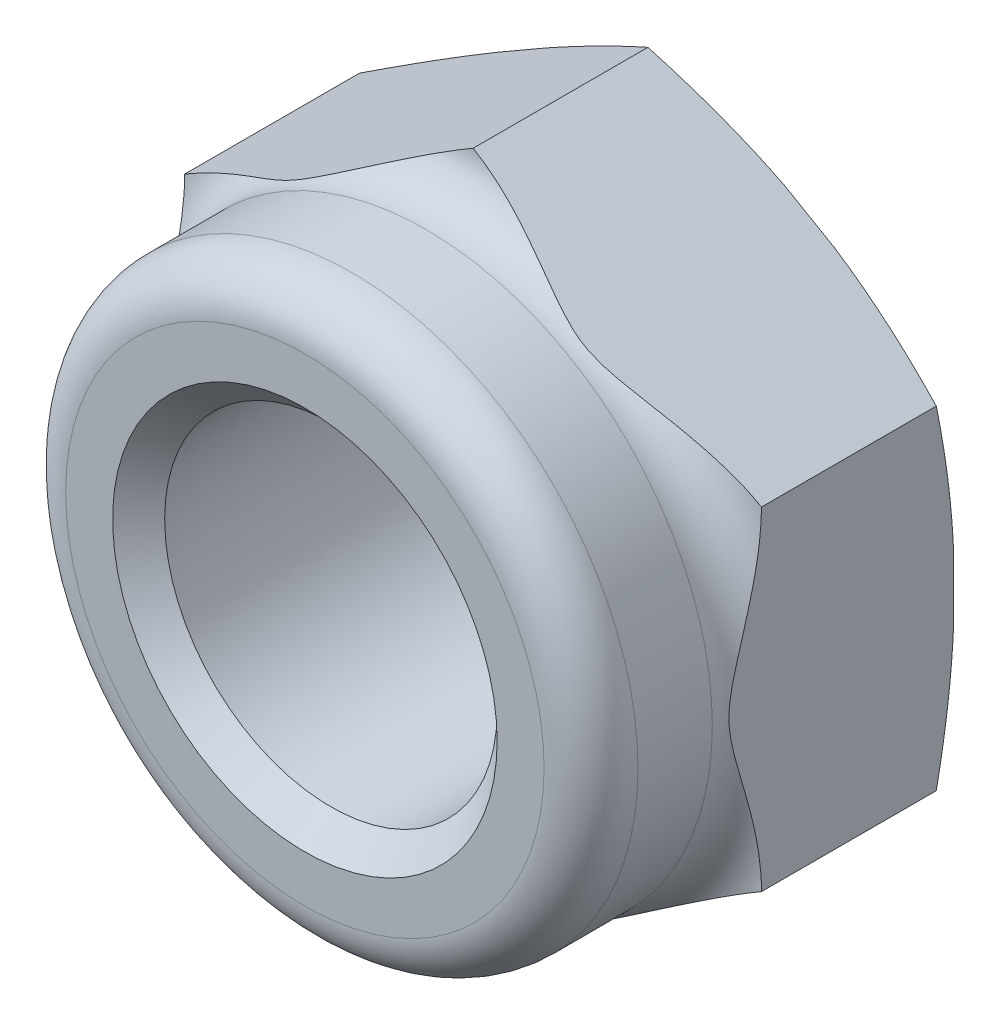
ISO-10303-21;
HEADER;
FILE_DESCRIPTION(('STEP AP214'),'2;1');
FILE_NAME('part.step','',(''),(''),'','','');
FILE_SCHEMA(('AUTOMOTIVE_DESIGN { 1 0 10303 214 1 1 1 1 }'));
ENDSEC;
DATA;
#1=APPLICATION_CONTEXT('core data for automotive mechanical design processes');
#2=APPLICATION_PROTOCOL_DEFINITION('international standard','automotive_design',2000,#1);
#3=PRODUCT_CONTEXT('',#1,'mechanical');
#4=PRODUCT('Part','Part','',(#3));
#5=PRODUCT_RELATED_PRODUCT_CATEGORY('part','',(#4));
#6=PRODUCT_DEFINITION_FORMATION('','',#4);
#7=PRODUCT_DEFINITION_CONTEXT('part definition',#1,'design');
#8=PRODUCT_DEFINITION('design','',#6,#7);
#9=PRODUCT_DEFINITION_SHAPE('','',#8);
#10=(LENGTH_UNIT() NAMED_UNIT(*) SI_UNIT(.MILLI.,.METRE.));
#11=(NAMED_UNIT(*) PLANE_ANGLE_UNIT() SI_UNIT($,.RADIAN.));
#12=(NAMED_UNIT(*) SI_UNIT($,.STERADIAN.) SOLID_ANGLE_UNIT());
#13=UNCERTAINTY_MEASURE_WITH_UNIT(LENGTH_MEASURE(1.E-05),#10,'distance_accuracy_value','');
#14=(GEOMETRIC_REPRESENTATION_CONTEXT(3) GLOBAL_UNCERTAINTY_ASSIGNED_CONTEXT((#13)) GLOBAL_UNIT_ASSIGNED_CONTEXT((#10,
#11,#12)) REPRESENTATION_CONTEXT('',''));
#15=CARTESIAN_POINT('',(0.,0.,0.));
#16=DIRECTION('',(0.,0.,1.));
#17=DIRECTION('',(1.,0.,0.));
#18=AXIS2_PLACEMENT_3D('',#15,#16,#17);
#19=CARTESIAN_POINT('',(0.,0.,0.));
#20=DIRECTION('',(0.,0.,1.));
#21=DIRECTION('',(1.,0.,0.));
#22=AXIS2_PLACEMENT_3D('',#19,#20,#21);
#23=PLANE('',#22);
#24=CARTESIAN_POINT('',(0.,0.,0.));
#25=DIRECTION('',(0.,0.,-1.));
#26=DIRECTION('',(1.,0.,0.));
#27=AXIS2_PLACEMENT_3D('',#24,#25,#26);
#28=CIRCLE('',#27,8.);
#29=CARTESIAN_POINT('',(8.,0.,0.));
#30=VERTEX_POINT('',#29);
#31=EDGE_CURVE('E34',#30,#30,#28,.T.);
#32=ORIENTED_EDGE('',*,*,#31,.F.);
#33=EDGE_LOOP('',(#32));
#34=FACE_BOUND('',#33,.T.);
#35=CARTESIAN_POINT('',(0.,0.,0.));
#36=DIRECTION('',(0.,0.,1.));
#37=DIRECTION('',(1.,0.,0.));
#38=AXIS2_PLACEMENT_3D('',#35,#36,#37);
#39=CIRCLE('',#38,12.0599368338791);
#40=CARTESIAN_POINT('',(12.,1.20086487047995,0.));
#41=VERTEX_POINT('',#40);
#42=CARTESIAN_POINT('',(7.02184828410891,9.80488261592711,0.));
#43=VERTEX_POINT('',#42);
#44=EDGE_CURVE('E138',#41,#43,#39,.T.);
#45=ORIENTED_EDGE('',*,*,#44,.F.);
#46=DIRECTION('',(0.,1.,0.));
#47=VECTOR('',#46,1.);
#48=CARTESIAN_POINT('',(12.,-6.93,0.));
#49=LINE('',#48,#47);
#50=CARTESIAN_POINT('',(12.,-1.20086487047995,0.));
#51=VERTEX_POINT('',#50);
#52=EDGE_CURVE('E161',#51,#41,#49,.T.);
#53=ORIENTED_EDGE('',*,*,#52,.F.);
#54=CARTESIAN_POINT('',(0.,0.,0.));
#55=DIRECTION('',(0.,0.,1.));
#56=DIRECTION('',(1.,0.,0.));
#57=AXIS2_PLACEMENT_3D('',#54,#55,#56);
#58=CIRCLE('',#57,12.0599368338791);
#59=CARTESIAN_POINT('',(7.02184828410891,-9.80488261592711,0.));
#60=VERTEX_POINT('',#59);
#61=EDGE_CURVE('E329',#60,#51,#58,.T.);
#62=ORIENTED_EDGE('',*,*,#61,.F.);
#63=DIRECTION('',(0.865969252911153,0.500097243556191,0.));
#64=VECTOR('',#63,1.);
#65=CARTESIAN_POINT('',(0.,-13.86,0.));
#66=LINE('',#65,#64);
#67=CARTESIAN_POINT('',(4.98281986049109,-10.9824215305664,0.));
#68=VERTEX_POINT('',#67);
#69=EDGE_CURVE('E28',#68,#60,#66,.T.);
#70=ORIENTED_EDGE('',*,*,#69,.F.);
#71=CARTESIAN_POINT('',(0.,0.,0.));
#72=DIRECTION('',(0.,0.,1.));
#73=DIRECTION('',(1.,0.,0.));
#74=AXIS2_PLACEMENT_3D('',#71,#72,#73);
#75=CIRCLE('',#74,12.0599368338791);
#76=CARTESIAN_POINT('',(-4.98281986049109,-10.9824215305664,0.));
#77=VERTEX_POINT('',#76);
#78=EDGE_CURVE('E147',#77,#68,#75,.T.);
#79=ORIENTED_EDGE('',*,*,#78,.F.);
#80=DIRECTION('',(0.865969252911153,-0.500097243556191,0.));
#81=VECTOR('',#80,1.);
#82=CARTESIAN_POINT('',(-12.,-6.93,0.));
#83=LINE('',#82,#81);
#84=CARTESIAN_POINT('',(-7.02184828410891,-9.80488261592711,0.));
#85=VERTEX_POINT('',#84);
#86=EDGE_CURVE('E114',#85,#77,#83,.T.);
#87=ORIENTED_EDGE('',*,*,#86,.F.);
#88=CARTESIAN_POINT('',(0.,0.,0.));
#89=DIRECTION('',(0.,0.,1.));
#90=DIRECTION('',(1.,0.,0.));
#91=AXIS2_PLACEMENT_3D('',#88,#89,#90);
#92=CIRCLE('',#91,12.0599368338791);
#93=CARTESIAN_POINT('',(-12.,-1.20086487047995,0.));
#94=VERTEX_POINT('',#93);
#95=EDGE_CURVE('E123',#94,#85,#92,.T.);
#96=ORIENTED_EDGE('',*,*,#95,.F.);
#97=DIRECTION('',(0.,-1.,0.));
#98=VECTOR('',#97,1.);
#99=CARTESIAN_POINT('',(-12.,6.93,0.));
#100=LINE('',#99,#98);
#101=CARTESIAN_POINT('',(-12.,1.20086487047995,0.));
#102=VERTEX_POINT('',#101);
#103=EDGE_CURVE('E128',#102,#94,#100,.T.);
#104=ORIENTED_EDGE('',*,*,#103,.F.);
#105=CARTESIAN_POINT('',(0.,0.,0.));
#106=DIRECTION('',(0.,0.,1.));
#107=DIRECTION('',(1.,0.,0.));
#108=AXIS2_PLACEMENT_3D('',#105,#106,#107);
#109=CIRCLE('',#108,12.0599368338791);
#110=CARTESIAN_POINT('',(-7.02184828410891,9.80488261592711,0.));
#111=VERTEX_POINT('',#110);
#112=EDGE_CURVE('E129',#111,#102,#109,.T.);
#113=ORIENTED_EDGE('',*,*,#112,.F.);
#114=DIRECTION('',(-0.865969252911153,-0.500097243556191,0.));
#115=VECTOR('',#114,1.);
#116=CARTESIAN_POINT('',(0.,13.86,0.));
#117=LINE('',#116,#115);
#118=CARTESIAN_POINT('',(-4.98281986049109,10.9824215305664,0.));
#119=VERTEX_POINT('',#118);
#120=EDGE_CURVE('E11',#119,#111,#117,.T.);
#121=ORIENTED_EDGE('',*,*,#120,.F.);
#122=CARTESIAN_POINT('',(0.,0.,0.));
#123=DIRECTION('',(0.,0.,1.));
#124=DIRECTION('',(1.,0.,0.));
#125=AXIS2_PLACEMENT_3D('',#122,#123,#124);
#126=CIRCLE('',#125,12.0599368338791);
#127=CARTESIAN_POINT('',(4.98281986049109,10.9824215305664,0.));
#128=VERTEX_POINT('',#127);
#129=EDGE_CURVE('E155',#128,#119,#126,.T.);
#130=ORIENTED_EDGE('',*,*,#129,.F.);
#131=DIRECTION('',(-0.865969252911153,0.500097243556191,0.));
#132=VECTOR('',#131,1.);
#133=CARTESIAN_POINT('',(12.,6.93,0.));
#134=LINE('',#133,#132);
#135=EDGE_CURVE('E167',#43,#128,#134,.T.);
#136=ORIENTED_EDGE('',*,*,#135,.F.);
#137=EDGE_LOOP('',(#45,#53,#62,#70,#79,#87,#96,#104,#113,#121,#130,#136));
#138=FACE_BOUND('',#137,.T.);
#139=ADVANCED_FACE('F16',(#34,#138),#23,.F.);
#140=CARTESIAN_POINT('',(0.,0.,15.));
#141=DIRECTION('',(0.,0.,1.));
#142=DIRECTION('',(1.,0.,0.));
#143=AXIS2_PLACEMENT_3D('',#140,#141,#142);
#144=PLANE('',#143);
#145=CARTESIAN_POINT('',(0.,0.,15.));
#146=DIRECTION('',(0.,0.,1.));
#147=DIRECTION('',(1.,0.,0.));
#148=AXIS2_PLACEMENT_3D('',#145,#146,#147);
#149=CIRCLE('',#148,8.);
#150=CARTESIAN_POINT('',(8.,0.,15.));
#151=VERTEX_POINT('',#150);
#152=EDGE_CURVE('E101',#151,#151,#149,.T.);
#153=ORIENTED_EDGE('',*,*,#152,.F.);
#154=EDGE_LOOP('',(#153));
#155=FACE_BOUND('',#154,.T.);
#156=CARTESIAN_POINT('',(0.,0.,15.));
#157=DIRECTION('',(0.,0.,1.));
#158=DIRECTION('',(1.,0.,0.));
#159=AXIS2_PLACEMENT_3D('',#156,#157,#158);
#160=CIRCLE('',#159,9.95333333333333);
#161=CARTESIAN_POINT('',(9.95333333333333,0.,15.));
#162=VERTEX_POINT('',#161);
#163=EDGE_CURVE('E109',#162,#162,#160,.T.);
#164=ORIENTED_EDGE('',*,*,#163,.T.);
#165=EDGE_LOOP('',(#164));
#166=FACE_BOUND('',#165,.T.);
#167=ADVANCED_FACE('F285',(#155,#166),#144,.T.);
#168=CARTESIAN_POINT('',(-6.,10.395,0.));
#169=DIRECTION('',(-0.500097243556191,0.865969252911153,0.));
#170=DIRECTION('',(-0.865969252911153,-0.500097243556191,0.));
#171=AXIS2_PLACEMENT_3D('',#168,#169,#170);
#172=PLANE('',#171);
#173=CARTESIAN_POINT('',(-12.0046681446,6.9273041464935,0.727272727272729));
#174=CARTESIAN_POINT('',(-9.34023714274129,8.46601305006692,0.105593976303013));
#175=CARTESIAN_POINT('',(-7.02184828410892,9.8048826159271,0.));
#176=(BOUNDED_CURVE() B_SPLINE_CURVE(2,(#173,#174,#175),.UNSPECIFIED.,.F.,
.F.) B_SPLINE_CURVE_WITH_KNOTS((3,3),(0.,5.80453793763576),
.UNSPECIFIED.) CURVE() GEOMETRIC_REPRESENTATION_ITEM() RATIONAL_B_SPLINE_CURVE((1.,
1.025590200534,1.)) REPRESENTATION_ITEM(''));
#177=CARTESIAN_POINT('',(-12.,6.93,0.726183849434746));
#178=VERTEX_POINT('',#177);
#179=EDGE_CURVE('E133',#178,#111,#176,.T.);
#180=ORIENTED_EDGE('',*,*,#179,.F.);
#181=DIRECTION('',(0.,0.,1.));
#182=VECTOR('',#181,1.);
#183=CARTESIAN_POINT('',(-12.,6.93,0.));
#184=LINE('',#183,#182);
#185=CARTESIAN_POINT('',(-12.,6.93,8.00000185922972));
#186=VERTEX_POINT('',#185);
#187=EDGE_CURVE('E116',#178,#186,#184,.T.);
#188=ORIENTED_EDGE('',*,*,#187,.T.);
#189=CARTESIAN_POINT('',(-1.33280624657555E-09,13.8599999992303,7.99999999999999));
#190=CARTESIAN_POINT('',(-0.0813561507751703,13.8130167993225,8.00000490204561));
#191=CARTESIAN_POINT('',(-0.162701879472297,13.7660357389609,8.00169503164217));
#192=CARTESIAN_POINT('',(-0.32745807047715,13.6708770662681,8.00825926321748));
#193=CARTESIAN_POINT('',(-0.410866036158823,13.6227007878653,8.01321667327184));
#194=CARTESIAN_POINT('',(-0.579629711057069,13.5252230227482,8.02626559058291));
#195=CARTESIAN_POINT('',(-0.664980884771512,13.4759241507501,8.03443375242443));
#196=CARTESIAN_POINT('',(-0.837532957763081,13.3762618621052,8.05384543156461));
#197=CARTESIAN_POINT('',(-0.924727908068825,13.3259019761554,8.06515943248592));
#198=CARTESIAN_POINT('',(-1.10087962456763,13.2241686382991,8.09078765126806));
#199=CARTESIAN_POINT('',(-1.1898293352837,13.1727993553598,8.10516644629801));
#200=CARTESIAN_POINT('',(-1.36942150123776,13.0690937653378,8.13683169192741));
#201=CARTESIAN_POINT('',(-1.46005623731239,13.0167621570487,8.15417703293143));
#202=CARTESIAN_POINT('',(-1.63203357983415,12.9174422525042,8.18944457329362));
#203=CARTESIAN_POINT('',(-1.71341196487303,12.8704354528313,8.20714160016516));
#204=CARTESIAN_POINT('',(-1.87662458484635,12.7761474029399,8.24447434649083));
#205=CARTESIAN_POINT('',(-1.9584559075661,12.7288677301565,8.26412673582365));
#206=CARTESIAN_POINT('',(-2.12259494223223,12.6340488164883,8.30522072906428));
#207=CARTESIAN_POINT('',(-2.20489986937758,12.5865113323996,8.32667745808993));
#208=CARTESIAN_POINT('',(-2.37000716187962,12.4911688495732,8.37123306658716));
#209=CARTESIAN_POINT('',(-2.45280683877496,12.4433655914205,8.39434559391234));
#210=CARTESIAN_POINT('',(-2.61893054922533,12.3474706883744,8.44206304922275));
#211=CARTESIAN_POINT('',(-2.7022520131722,12.2993806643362,8.46668014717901));
#212=CARTESIAN_POINT('',(-2.86944358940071,12.2028698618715,8.51726338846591));
#213=CARTESIAN_POINT('',(-2.95331119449,12.1544503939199,8.54324029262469));
#214=CARTESIAN_POINT('',(-3.11916083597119,12.0586729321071,8.59559817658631));
#215=CARTESIAN_POINT('',(-3.20114740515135,12.0113128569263,8.62196104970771));
#216=CARTESIAN_POINT('',(-3.36342682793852,11.9175890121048,8.67481789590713));
#217=CARTESIAN_POINT('',(-3.44372244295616,11.8712233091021,8.70130000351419));
#218=CARTESIAN_POINT('',(-3.60272960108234,11.7794072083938,8.75415893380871));
#219=CARTESIAN_POINT('',(-3.68144292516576,11.7339557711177,8.78052861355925));
#220=CARTESIAN_POINT('',(-3.84680852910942,11.6384488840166,8.83609788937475));
#221=CARTESIAN_POINT('',(-3.93345597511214,11.5883942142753,8.86531314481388));
#222=CARTESIAN_POINT('',(-4.10197996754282,11.4910591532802,8.92183934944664));
#223=CARTESIAN_POINT('',(-4.18385224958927,11.4437802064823,8.94916540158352));
#224=CARTESIAN_POINT('',(-4.34301619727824,11.3518706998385,9.00157691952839));
#225=CARTESIAN_POINT('',(-4.42029834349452,11.3072454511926,9.02670045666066));
#226=CARTESIAN_POINT('',(-4.58894061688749,11.209871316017,9.08026332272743));
#227=CARTESIAN_POINT('',(-4.68035142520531,11.1570941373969,9.10849408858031));
#228=CARTESIAN_POINT('',(-4.85613827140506,11.0555989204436,9.16020168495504));
#229=CARTESIAN_POINT('',(-4.9404696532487,11.0069068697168,9.18387859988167));
#230=CARTESIAN_POINT('',(-5.1022837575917,10.9134411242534,9.22616310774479));
#231=CARTESIAN_POINT('',(-5.1797156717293,10.8686999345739,9.24503349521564));
#232=CARTESIAN_POINT('',(-5.34337097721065,10.7742149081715,9.28065708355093));
#233=CARTESIAN_POINT('',(-5.42967001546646,10.7244354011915,9.29698503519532));
#234=CARTESIAN_POINT('',(-5.55793658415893,10.6504131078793,9.31670352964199));
#235=CARTESIAN_POINT('',(-5.59964874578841,10.6263357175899,9.32240889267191));
#236=CARTESIAN_POINT('',(-5.68214028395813,10.5786977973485,9.33217890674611));
#237=CARTESIAN_POINT('',(-5.72291647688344,10.5551396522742,9.33628151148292));
#238=CARTESIAN_POINT('',(-5.80354978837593,10.5085393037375,9.34283126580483));
#239=CARTESIAN_POINT('',(-5.84340470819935,10.4854987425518,9.34531683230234));
#240=CARTESIAN_POINT('',(-5.92221454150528,10.4399417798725,9.34862732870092));
#241=CARTESIAN_POINT('',(-5.96116817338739,10.4174260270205,9.34949056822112));
#242=CARTESIAN_POINT('',(-6.03908548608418,10.3724275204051,9.34955259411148));
#243=CARTESIAN_POINT('',(-6.07804916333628,10.3499447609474,9.34875171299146));
#244=CARTESIAN_POINT('',(-6.15688092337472,10.3044624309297,9.34556286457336));
#245=CARTESIAN_POINT('',(-6.19674786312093,10.2814636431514,9.34313662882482));
#246=CARTESIAN_POINT('',(-6.27739081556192,10.2349273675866,9.33670366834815));
#247=CARTESIAN_POINT('',(-6.31816435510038,10.2113909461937,9.33265857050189));
#248=CARTESIAN_POINT('',(-6.40063029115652,10.1637669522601,9.32300109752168));
#249=CARTESIAN_POINT('',(-6.44231907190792,10.1396809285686,9.31735077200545));
#250=CARTESIAN_POINT('',(-6.57049184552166,10.0656108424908,9.29779713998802));
#251=CARTESIAN_POINT('',(-6.65670619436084,10.0157639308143,9.28157313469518));
#252=CARTESIAN_POINT('',(-6.82028914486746,9.92126890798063,9.24612227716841));
#253=CARTESIAN_POINT('',(-6.89772635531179,9.87657318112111,9.22732195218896));
#254=CARTESIAN_POINT('',(-7.05954234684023,9.78314316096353,9.1851599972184));
#255=CARTESIAN_POINT('',(-7.14386722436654,9.73443688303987,9.16153296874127));
#256=CARTESIAN_POINT('',(-7.31965548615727,9.63289750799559,9.10990835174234));
#257=CARTESIAN_POINT('',(-7.41107362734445,9.58009021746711,9.08170873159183));
#258=CARTESIAN_POINT('',(-7.57970735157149,9.48268647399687,9.02819617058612));
#259=CARTESIAN_POINT('',(-7.65697332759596,9.43805988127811,9.00309441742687));
#260=CARTESIAN_POINT('',(-7.81614861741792,9.34612857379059,8.95070405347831));
#261=CARTESIAN_POINT('',(-7.89804836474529,9.29882961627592,8.92337643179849));
#262=CARTESIAN_POINT('',(-8.06668376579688,9.20145534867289,8.86682622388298));
#263=CARTESIAN_POINT('',(-8.15341588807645,9.15138306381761,8.83758799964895));
#264=CARTESIAN_POINT('',(-8.31879589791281,9.0558838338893,8.78201181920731));
#265=CARTESIAN_POINT('',(-8.39744078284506,9.01046066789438,8.7556584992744));
#266=CARTESIAN_POINT('',(-8.55634357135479,8.91868393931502,8.70281539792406));
#267=CARTESIAN_POINT('',(-8.63660328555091,8.87232935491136,8.6763328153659));
#268=CARTESIAN_POINT('',(-8.79885859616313,8.77863472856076,8.62345959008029));
#269=CARTESIAN_POINT('',(-8.88085729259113,8.7312932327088,8.59708099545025));
#270=CARTESIAN_POINT('',(-9.04668240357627,8.63552798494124,8.54469561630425));
#271=CARTESIAN_POINT('',(-9.13051280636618,8.58710139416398,8.51870658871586));
#272=CARTESIAN_POINT('',(-9.29762767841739,8.49054978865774,8.46809122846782));
#273=CARTESIAN_POINT('',(-9.38090979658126,8.44242626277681,8.44345431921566));
#274=CARTESIAN_POINT('',(-9.54697798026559,8.34648061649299,8.39569010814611));
#275=CARTESIAN_POINT('',(-9.62976139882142,8.2986598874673,8.37255084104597));
#276=CARTESIAN_POINT('',(-9.79486454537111,8.20330647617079,8.32793527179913));
#277=CARTESIAN_POINT('',(-9.87718146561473,8.15577522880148,8.30644555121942));
#278=CARTESIAN_POINT('',(-10.0413696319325,8.06098588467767,8.26527987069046));
#279=CARTESIAN_POINT('',(-10.1232380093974,8.01372929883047,8.24558904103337));
#280=CARTESIAN_POINT('',(-10.2865266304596,7.91946285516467,8.20817468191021));
#281=CARTESIAN_POINT('',(-10.3679440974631,7.87245470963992,8.19043476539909));
#282=CARTESIAN_POINT('',(-10.5399369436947,7.77313075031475,8.15508502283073));
#283=CARTESIAN_POINT('',(-10.6305460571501,7.72079326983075,8.13769881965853));
#284=CARTESIAN_POINT('',(-10.8101014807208,7.61709016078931,8.10594637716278));
#285=CARTESIAN_POINT('',(-10.8990398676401,7.56572885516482,8.09152149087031));
#286=CARTESIAN_POINT('',(-11.0751777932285,7.46401477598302,8.06579607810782));
#287=CARTESIAN_POINT('',(-11.1623701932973,7.41366602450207,8.05443123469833));
#288=CARTESIAN_POINT('',(-11.33492630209,7.31402868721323,8.03491324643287));
#289=CARTESIAN_POINT('',(-11.4202839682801,7.26474349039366,8.02668989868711));
#290=CARTESIAN_POINT('',(-11.5890664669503,7.16728897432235,8.01352646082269));
#291=CARTESIAN_POINT('',(-11.6724867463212,7.11912228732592,8.00851001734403));
#292=CARTESIAN_POINT('',(-11.8372703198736,7.02397226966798,8.00182404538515));
#293=CARTESIAN_POINT('',(-11.9186311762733,6.97699045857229,8.00007153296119));
#294=CARTESIAN_POINT('',(-11.9999999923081,6.9299999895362,8.00000185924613));
#295=B_SPLINE_CURVE_WITH_KNOTS('',3,(#189,#190,#191,#192,#193,#194,#195,#196,#197,#198,#199,
#200,#201,#202,#203,#204,#205,#206,#207,#208,#209,#210,#211,#212,#213,#214,#215,#216,#217,#218,
#219,#220,#221,#222,#223,#224,#225,#226,#227,#228,#229,#230,#231,#232,#233,#234,#235,#236,#237,
#238,#239,#240,#241,#242,#243,#244,#245,#246,#247,#248,#249,#250,#251,#252,#253,#254,#255,#256,
#257,#258,#259,#260,#261,#262,#263,#264,#265,#266,#267,#268,#269,#270,#271,#272,#273,#274,#275,
#276,#277,#278,#279,#280,#281,#282,#283,#284,#285,#286,#287,#288,#289,#290,#291,#292,#293,#294),
.UNSPECIFIED.,.F.,.F.,(4,2,2,2,2,2,2,2,2,2,2,2,2,2,2,2,2,2,2,2,2,2,2,2,2,2,2,2,2,2,2,2,2,2,2,2,
2,2,2,2,2,2,2,2,2,2,2,2,2,2,2,2,4),(0.,0.281814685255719,0.571108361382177,0.867774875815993,
1.17171419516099,1.48283554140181,1.80106020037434,2.08793470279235,2.37750759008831,
2.66981123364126,2.96488794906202,3.2627898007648,3.56357833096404,3.85842763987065,
4.14771198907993,4.43163558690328,4.74436730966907,5.03960456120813,5.31773146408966,
5.64550104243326,5.94611362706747,6.2202562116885,6.52295314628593,6.66843120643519,
6.8102183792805,6.94850046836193,7.0834740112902,7.21842058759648,7.3566616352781,
7.49839446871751,7.64380563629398,7.9463337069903,8.22037895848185,8.52096003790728,
8.84876722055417,9.1268378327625,9.42217373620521,9.73516130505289,10.0188597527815,
10.3080388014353,10.60290429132,10.9036192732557,11.2014855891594,11.4965656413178,
11.788912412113,12.078569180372,12.3655693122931,12.6837571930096,12.9948568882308,
13.2987902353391,13.5954669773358,13.8847875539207,14.1666462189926),.UNSPECIFIED.);
#296=CARTESIAN_POINT('',(0.,13.86,8.));
#297=VERTEX_POINT('',#296);
#298=EDGE_CURVE('E423',#297,#186,#295,.T.);
#299=ORIENTED_EDGE('',*,*,#298,.F.);
#300=DIRECTION('',(0.,0.,1.));
#301=VECTOR('',#300,1.);
#302=CARTESIAN_POINT('',(0.,13.86,0.));
#303=LINE('',#302,#301);
#304=CARTESIAN_POINT('',(0.,13.86,0.727272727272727));
#305=VERTEX_POINT('',#304);
#306=EDGE_CURVE('E172',#305,#297,#303,.T.);
#307=ORIENTED_EDGE('',*,*,#306,.F.);
#308=CARTESIAN_POINT('',(-4.98281986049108,10.9824215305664,0.));
#309=CARTESIAN_POINT('',(-2.66443100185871,12.3212910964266,0.105593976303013));
#310=CARTESIAN_POINT('',(0.,13.86,0.727272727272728));
#311=(BOUNDED_CURVE() B_SPLINE_CURVE(2,(#308,#309,#310),.UNSPECIFIED.,.F.,
.F.) B_SPLINE_CURVE_WITH_KNOTS((3,3),(0.,5.80453793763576),
.UNSPECIFIED.) CURVE() GEOMETRIC_REPRESENTATION_ITEM() RATIONAL_B_SPLINE_CURVE((1.,
1.02559020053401,1.)) REPRESENTATION_ITEM(''));
#312=EDGE_CURVE('E158',#119,#305,#311,.T.);
#313=ORIENTED_EDGE('',*,*,#312,.F.);
#314=ORIENTED_EDGE('',*,*,#120,.T.);
#315=EDGE_LOOP('',(#180,#188,#299,#307,#313,#314));
#316=FACE_BOUND('',#315,.T.);
#317=ADVANCED_FACE('F288',(#316),#172,.T.);
#318=CARTESIAN_POINT('',(6.,-10.395,0.));
#319=DIRECTION('',(0.500097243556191,-0.865969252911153,0.));
#320=DIRECTION('',(0.865969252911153,0.500097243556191,0.));
#321=AXIS2_PLACEMENT_3D('',#318,#319,#320);
#322=PLANE('',#321);
#323=CARTESIAN_POINT('',(12.0046681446,-6.9273041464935,0.727272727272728));
#324=CARTESIAN_POINT('',(9.34023714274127,-8.46601305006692,0.105593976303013));
#325=CARTESIAN_POINT('',(7.0218482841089,-9.80488261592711,0.));
#326=(BOUNDED_CURVE() B_SPLINE_CURVE(2,(#323,#324,#325),.UNSPECIFIED.,.F.,
.F.) B_SPLINE_CURVE_WITH_KNOTS((3,3),(0.,5.80453793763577),
.UNSPECIFIED.) CURVE() GEOMETRIC_REPRESENTATION_ITEM() RATIONAL_B_SPLINE_CURVE((1.,
1.025590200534,1.)) REPRESENTATION_ITEM(''));
#327=CARTESIAN_POINT('',(12.,-6.93,0.726183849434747));
#328=VERTEX_POINT('',#327);
#329=EDGE_CURVE('E146',#328,#60,#326,.T.);
#330=ORIENTED_EDGE('',*,*,#329,.F.);
#331=DIRECTION('',(0.,0.,1.));
#332=VECTOR('',#331,1.);
#333=CARTESIAN_POINT('',(12.,-6.93,0.));
#334=LINE('',#333,#332);
#335=CARTESIAN_POINT('',(12.,-6.93,8.00000185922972));
#336=VERTEX_POINT('',#335);
#337=EDGE_CURVE('E177',#328,#336,#334,.T.);
#338=ORIENTED_EDGE('',*,*,#337,.T.);
#339=CARTESIAN_POINT('',(0.,-13.8599999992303,7.99999999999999));
#340=CARTESIAN_POINT('',(0.081356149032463,-13.8130167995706,8.00000490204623));
#341=CARTESIAN_POINT('',(0.162701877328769,-13.7660357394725,8.00169503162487));
#342=CARTESIAN_POINT('',(0.327458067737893,-13.670877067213,8.00825926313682));
#343=CARTESIAN_POINT('',(0.410866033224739,-13.6227007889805,8.01321667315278));
#344=CARTESIAN_POINT('',(0.579629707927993,-13.5252230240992,8.02626559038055));
#345=CARTESIAN_POINT('',(0.664980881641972,-13.475924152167,8.03443375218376));
#346=CARTESIAN_POINT('',(0.837532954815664,-13.3762618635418,8.05384543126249));
#347=CARTESIAN_POINT('',(0.924727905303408,-13.325901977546,8.06515943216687));
#348=CARTESIAN_POINT('',(1.10087962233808,-13.2241686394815,8.09078765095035));
#349=CARTESIAN_POINT('',(1.18982933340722,-13.1727993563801,8.1051664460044));
#350=CARTESIAN_POINT('',(1.36942150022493,-13.0690937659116,8.13683169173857));
#351=CARTESIAN_POINT('',(1.46005623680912,-13.0167621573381,8.15417703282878));
#352=CARTESIAN_POINT('',(1.6320335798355,-12.9174422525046,8.1894445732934));
#353=CARTESIAN_POINT('',(1.71341196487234,-12.8704354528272,8.20714160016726));
#354=CARTESIAN_POINT('',(1.87662458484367,-12.7761474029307,8.24447434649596));
#355=CARTESIAN_POINT('',(1.9584559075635,-12.7288677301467,8.26412673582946));
#356=CARTESIAN_POINT('',(2.12259494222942,-12.6340488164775,8.30522072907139));
#357=CARTESIAN_POINT('',(2.20489986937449,-12.5865113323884,8.32667745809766));
#358=CARTESIAN_POINT('',(2.37000716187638,-12.4911688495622,8.37123306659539));
#359=CARTESIAN_POINT('',(2.45280683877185,-12.4433655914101,8.39434559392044));
#360=CARTESIAN_POINT('',(2.61893054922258,-12.347470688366,8.44206304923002));
#361=CARTESIAN_POINT('',(2.70225201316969,-12.299380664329,8.46668014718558));
#362=CARTESIAN_POINT('',(2.86944358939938,-12.2028698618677,8.51726338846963));
#363=CARTESIAN_POINT('',(2.95331119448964,-12.1544503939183,8.54324029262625));
#364=CARTESIAN_POINT('',(3.11916083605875,-12.0586729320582,8.59559817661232));
#365=CARTESIAN_POINT('',(3.20114740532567,-12.011312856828,8.62196104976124));
#366=CARTESIAN_POINT('',(3.3634268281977,-11.9175890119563,8.67481789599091));
#367=CARTESIAN_POINT('',(3.44372244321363,-11.8712233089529,8.70130000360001));
#368=CARTESIAN_POINT('',(3.60272960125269,-11.7794072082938,8.75415893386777));
#369=CARTESIAN_POINT('',(3.68144292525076,-11.7339557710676,8.78052861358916));
#370=CARTESIAN_POINT('',(3.84680852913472,-11.6384488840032,8.83609788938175));
#371=CARTESIAN_POINT('',(3.9334559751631,-11.5883942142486,8.86531314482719));
#372=CARTESIAN_POINT('',(4.10197996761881,-11.4910591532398,8.92183934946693));
#373=CARTESIAN_POINT('',(4.18385224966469,-11.4437802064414,8.94916540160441));
#374=CARTESIAN_POINT('',(4.34301619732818,-11.3518706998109,9.00157691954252));
#375=CARTESIAN_POINT('',(4.42029834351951,-11.3072454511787,9.02670045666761));
#376=CARTESIAN_POINT('',(4.58894061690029,-11.2098713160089,9.08026332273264));
#377=CARTESIAN_POINT('',(4.68035142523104,-11.1570941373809,9.10849408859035));
#378=CARTESIAN_POINT('',(4.85613827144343,-11.0555989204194,9.16020168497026));
#379=CARTESIAN_POINT('',(4.94046965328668,-11.0069068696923,9.1838785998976));
#380=CARTESIAN_POINT('',(5.10228375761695,-10.9134411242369,9.22616310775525));
#381=CARTESIAN_POINT('',(5.179715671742,-10.8686999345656,9.24503349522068));
#382=CARTESIAN_POINT('',(5.34337097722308,-10.7742149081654,9.28065708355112));
#383=CARTESIAN_POINT('',(5.4296700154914,-10.7244354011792,9.29698503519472));
#384=CARTESIAN_POINT('',(5.5579365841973,-10.6504131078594,9.31670352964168));
#385=CARTESIAN_POINT('',(5.59964874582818,-10.626335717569,9.32240889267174));
#386=CARTESIAN_POINT('',(5.68214028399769,-10.5786977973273,9.33217890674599));
#387=CARTESIAN_POINT('',(5.72291647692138,-10.5551396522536,9.33628151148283));
#388=CARTESIAN_POINT('',(5.80354978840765,-10.50853930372,9.34283126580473));
#389=CARTESIAN_POINT('',(5.84340470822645,-10.4854987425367,9.34531683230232));
#390=CARTESIAN_POINT('',(5.92221454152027,-10.4399417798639,9.34862732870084));
#391=CARTESIAN_POINT('',(5.96116817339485,-10.4174260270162,9.34949056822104));
#392=CARTESIAN_POINT('',(6.03908548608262,-10.372427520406,9.34955259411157));
#393=CARTESIAN_POINT('',(6.07804916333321,-10.3499447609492,9.34875171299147));
#394=CARTESIAN_POINT('',(6.15688092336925,-10.304462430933,9.34556286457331));
#395=CARTESIAN_POINT('',(6.19674786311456,-10.2814636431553,9.34313662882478));
#396=CARTESIAN_POINT('',(6.27739081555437,-10.2349273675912,9.33670366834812));
#397=CARTESIAN_POINT('',(6.31816435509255,-10.2113909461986,9.33265857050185));
#398=CARTESIAN_POINT('',(6.40063029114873,-10.163766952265,9.32300109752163));
#399=CARTESIAN_POINT('',(6.44231907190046,-10.1396809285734,9.31735077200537));
#400=CARTESIAN_POINT('',(6.57049184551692,-10.065610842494,9.29779713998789));
#401=CARTESIAN_POINT('',(6.65670619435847,-10.0157639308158,9.28157313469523));
#402=CARTESIAN_POINT('',(6.82028914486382,-9.92126890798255,9.24612227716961));
#403=CARTESIAN_POINT('',(6.89772635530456,-9.87657318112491,9.22732195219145));
#404=CARTESIAN_POINT('',(7.05954234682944,-9.78314316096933,9.18515999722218));
#405=CARTESIAN_POINT('',(7.14386722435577,-9.73443688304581,9.16153296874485));
#406=CARTESIAN_POINT('',(7.31965548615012,-9.63289750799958,9.10990835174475));
#407=CARTESIAN_POINT('',(7.41107362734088,-9.58009021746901,9.0817087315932));
#408=CARTESIAN_POINT('',(7.57970735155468,-9.48268647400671,9.02819617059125));
#409=CARTESIAN_POINT('',(7.6569733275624,-9.4380598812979,9.00309441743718));
#410=CARTESIAN_POINT('',(7.81614861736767,-9.34612857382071,8.9507040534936));
#411=CARTESIAN_POINT('',(7.89804836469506,-9.29882961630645,8.92337643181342));
#412=CARTESIAN_POINT('',(8.06668376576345,-9.20145534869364,8.86682622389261));
#413=CARTESIAN_POINT('',(8.15341588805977,-9.15138306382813,8.83758799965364));
#414=CARTESIAN_POINT('',(8.3187958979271,-9.05588383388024,8.78201181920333));
#415=CARTESIAN_POINT('',(8.39744078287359,-9.01046066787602,8.75565849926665));
#416=CARTESIAN_POINT('',(8.55634357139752,-8.91868393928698,8.70281539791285));
#417=CARTESIAN_POINT('',(8.63660328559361,-8.87232935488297,8.67633281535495));
#418=CARTESIAN_POINT('',(8.79885859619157,-8.77863472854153,8.62345959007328));
#419=CARTESIAN_POINT('',(8.88085729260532,-8.73129323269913,8.5970809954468));
#420=CARTESIAN_POINT('',(9.04668240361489,-8.63552798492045,8.544695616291));
#421=CARTESIAN_POINT('',(9.1305128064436,-8.58710139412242,8.51870658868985));
#422=CARTESIAN_POINT('',(9.29762767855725,-8.49054978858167,8.46809122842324));
#423=CARTESIAN_POINT('',(9.38090979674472,-8.44242626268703,8.44345431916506));
#424=CARTESIAN_POINT('',(9.54697798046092,-8.34648061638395,8.39569010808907));
#425=CARTESIAN_POINT('',(9.62976139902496,-8.29865988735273,8.37255084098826));
#426=CARTESIAN_POINT('',(9.79486454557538,-8.20330647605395,8.32793527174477));
#427=CARTESIAN_POINT('',(9.87718146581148,-8.15577522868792,8.30644555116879));
#428=CARTESIAN_POINT('',(10.0413696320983,-8.06098588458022,8.26527987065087));
#429=CARTESIAN_POINT('',(10.1232380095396,-8.01372929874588,8.24558904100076));
#430=CARTESIAN_POINT('',(10.2865266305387,-7.91946285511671,8.20817468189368));
#431=CARTESIAN_POINT('',(10.3679440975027,-7.87245470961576,8.19043476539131));
#432=CARTESIAN_POINT('',(10.5399369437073,-7.7731307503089,8.15508502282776));
#433=CARTESIAN_POINT('',(10.6305460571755,-7.72079326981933,8.13769881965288));
#434=CARTESIAN_POINT('',(10.8101014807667,-7.61709016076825,8.10594637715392));
#435=CARTESIAN_POINT('',(10.8990398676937,-7.56572885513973,8.09152149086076));
#436=CARTESIAN_POINT('',(11.0751777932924,-7.4640147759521,8.06579607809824));
#437=CARTESIAN_POINT('',(11.1623701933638,-7.41366602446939,8.05443123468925));
#438=CARTESIAN_POINT('',(11.3349263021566,-7.31402868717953,8.03491324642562));
#439=CARTESIAN_POINT('',(11.4202839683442,-7.26474349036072,8.02668989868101));
#440=CARTESIAN_POINT('',(11.5890664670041,-7.1672889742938,8.01352646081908));
#441=CARTESIAN_POINT('',(11.6724867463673,-7.11912228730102,8.00851001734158));
#442=CARTESIAN_POINT('',(11.8372703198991,-7.02397226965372,8.0018240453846));
#443=CARTESIAN_POINT('',(11.918631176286,-6.97699045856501,8.00007153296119));
#444=CARTESIAN_POINT('',(11.9999999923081,-6.92999998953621,8.00000185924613));
#445=B_SPLINE_CURVE_WITH_KNOTS('',3,(#339,#340,#341,#342,#343,#344,#345,#346,#347,#348,#349,
#350,#351,#352,#353,#354,#355,#356,#357,#358,#359,#360,#361,#362,#363,#364,#365,#366,#367,#368,
#369,#370,#371,#372,#373,#374,#375,#376,#377,#378,#379,#380,#381,#382,#383,#384,#385,#386,#387,
#388,#389,#390,#391,#392,#393,#394,#395,#396,#397,#398,#399,#400,#401,#402,#403,#404,#405,#406,
#407,#408,#409,#410,#411,#412,#413,#414,#415,#416,#417,#418,#419,#420,#421,#422,#423,#424,#425,
#426,#427,#428,#429,#430,#431,#432,#433,#434,#435,#436,#437,#438,#439,#440,#441,#442,#443,#444),
.UNSPECIFIED.,.F.,.F.,(4,2,2,2,2,2,2,2,2,2,2,2,2,2,2,2,2,2,2,2,2,2,2,2,2,2,2,2,2,2,2,2,2,2,2,2,
2,2,2,2,2,2,2,2,2,2,2,2,2,2,2,2,4),(0.,0.281814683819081,0.571108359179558,0.867774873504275,
1.171714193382,1.48283554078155,1.8010602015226,2.08793470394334,2.37750759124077,
2.66981123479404,2.96488795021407,3.26278980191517,3.56357833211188,3.8584276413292,
4.14771199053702,4.43163558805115,4.74436731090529,5.03960456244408,5.31773146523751,
5.64550104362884,5.9461136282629,6.22025621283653,6.52295314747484,6.66843120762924,
6.81021838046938,6.9485004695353,7.08347401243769,7.21842058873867,7.35666163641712,
7.49839446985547,7.643805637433,7.9463337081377,8.22037895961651,8.52096003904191,
8.84876722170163,9.12683783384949,9.42217373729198,9.7351613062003,10.018859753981,
10.308038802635,10.6029042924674,10.9036192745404,11.2014855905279,11.4965656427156,
11.7889124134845,12.0785691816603,12.3655693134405,12.6837571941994,12.9948568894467,
13.2987902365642,13.5954669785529,13.884787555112,14.1666462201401),.UNSPECIFIED.);
#446=CARTESIAN_POINT('',(0.,-13.86,8.));
#447=VERTEX_POINT('',#446);
#448=EDGE_CURVE('E467',#447,#336,#445,.T.);
#449=ORIENTED_EDGE('',*,*,#448,.F.);
#450=DIRECTION('',(0.,0.,1.));
#451=VECTOR('',#450,1.);
#452=CARTESIAN_POINT('',(0.,-13.86,0.));
#453=LINE('',#452,#451);
#454=CARTESIAN_POINT('',(0.,-13.86,0.727272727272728));
#455=VERTEX_POINT('',#454);
#456=EDGE_CURVE('E115',#455,#447,#453,.T.);
#457=ORIENTED_EDGE('',*,*,#456,.F.);
#458=CARTESIAN_POINT('',(4.9828198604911,-10.9824215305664,0.));
#459=CARTESIAN_POINT('',(2.66443100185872,-12.3212910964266,0.105593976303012));
#460=CARTESIAN_POINT('',(0.,-13.86,0.727272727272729));
#461=(BOUNDED_CURVE() B_SPLINE_CURVE(2,(#458,#459,#460),.UNSPECIFIED.,.F.,
.F.) B_SPLINE_CURVE_WITH_KNOTS((3,3),(0.,5.80453793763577),
.UNSPECIFIED.) CURVE() GEOMETRIC_REPRESENTATION_ITEM() RATIONAL_B_SPLINE_CURVE((1.,
1.02559020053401,1.)) REPRESENTATION_ITEM(''));
#462=EDGE_CURVE('E153',#68,#455,#461,.T.);
#463=ORIENTED_EDGE('',*,*,#462,.F.);
#464=ORIENTED_EDGE('',*,*,#69,.T.);
#465=EDGE_LOOP('',(#330,#338,#449,#457,#463,#464));
#466=FACE_BOUND('',#465,.T.);
#467=ADVANCED_FACE('F18',(#466),#322,.T.);
#468=CARTESIAN_POINT('',(12.,0.,0.));
#469=DIRECTION('',(1.,0.,0.));
#470=DIRECTION('',(0.,1.,0.));
#471=AXIS2_PLACEMENT_3D('',#468,#469,#470);
#472=PLANE('',#471);
#473=CARTESIAN_POINT('',(12.,6.9353875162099,0.727272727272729));
#474=CARTESIAN_POINT('',(12.,3.86900335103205,0.107341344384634));
#475=CARTESIAN_POINT('',(12.,1.20086487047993,0.));
#476=(BOUNDED_CURVE() B_SPLINE_CURVE(2,(#473,#474,#475),.UNSPECIFIED.,.F.,
.F.) B_SPLINE_CURVE_WITH_KNOTS((3,3),(0.,5.78512095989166),
.UNSPECIFIED.) CURVE() GEOMETRIC_REPRESENTATION_ITEM() RATIONAL_B_SPLINE_CURVE((1.,
1.02541025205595,1.)) REPRESENTATION_ITEM(''));
#477=CARTESIAN_POINT('',(12.,6.93,0.726183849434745));
#478=VERTEX_POINT('',#477);
#479=EDGE_CURVE('E136',#478,#41,#476,.T.);
#480=ORIENTED_EDGE('',*,*,#479,.F.);
#481=DIRECTION('',(0.,0.,1.));
#482=VECTOR('',#481,1.);
#483=CARTESIAN_POINT('',(12.,6.93,0.));
#484=LINE('',#483,#482);
#485=CARTESIAN_POINT('',(12.,6.93,8.00000185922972));
#486=VERTEX_POINT('',#485);
#487=EDGE_CURVE('E182',#478,#486,#484,.T.);
#488=ORIENTED_EDGE('',*,*,#487,.T.);
#489=CARTESIAN_POINT('',(11.9999999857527,-6.92999999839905,8.00000185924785));
#490=CARTESIAN_POINT('',(12.000000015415,-6.83602729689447,8.00007160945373));
#491=CARTESIAN_POINT('',(11.9999968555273,-6.74206583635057,8.00182647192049));
#492=CARTESIAN_POINT('',(11.9999870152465,-6.55174972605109,8.00852226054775));
#493=CARTESIAN_POINT('',(11.9999802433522,-6.4553979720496,8.01354677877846));
#494=CARTESIAN_POINT('',(11.999966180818,-6.26043856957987,8.02673307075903));
#495=CARTESIAN_POINT('',(11.9999588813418,-6.16183622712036,8.03497177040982));
#496=CARTESIAN_POINT('',(11.9999471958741,-5.96249124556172,8.0545287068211));
#497=CARTESIAN_POINT('',(11.9999428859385,-5.86175559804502,8.06591768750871));
#498=CARTESIAN_POINT('',(11.9999374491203,-5.65824603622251,8.09170097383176));
#499=CARTESIAN_POINT('',(11.9999364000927,-5.55548039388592,8.10616010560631));
#500=CARTESIAN_POINT('',(11.9999433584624,-5.34799435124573,8.13799200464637));
#501=CARTESIAN_POINT('',(11.9999515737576,-5.2432830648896,8.15542390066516));
#502=CARTESIAN_POINT('',(11.9999488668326,-5.04467668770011,8.19084335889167));
#503=CARTESIAN_POINT('',(11.9999397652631,-4.95074079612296,8.20860355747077));
#504=CARTESIAN_POINT('',(11.9999121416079,-4.7623120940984,8.24606844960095));
#505=CARTESIAN_POINT('',(11.9998935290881,-4.66782270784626,8.26579031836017));
#506=CARTESIAN_POINT('',(11.9998695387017,-4.47827767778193,8.30703133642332));
#507=CARTESIAN_POINT('',(11.9998642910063,-4.38322543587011,8.32856606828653));
#508=CARTESIAN_POINT('',(11.9998705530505,-4.19253348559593,8.3732877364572));
#509=CARTESIAN_POINT('',(11.9998822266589,-4.09689708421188,8.396488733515));
#510=CARTESIAN_POINT('',(11.9999177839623,-3.90500401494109,8.44439493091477));
#511=CARTESIAN_POINT('',(11.9999417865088,-3.8087504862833,8.46911267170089));
#512=CARTESIAN_POINT('',(11.9999777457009,-3.61558181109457,8.51991049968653));
#513=CARTESIAN_POINT('',(11.9999895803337,-3.51866958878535,8.54600167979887));
#514=CARTESIAN_POINT('',(11.9999898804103,-3.32705739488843,8.59858076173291));
#515=CARTESIAN_POINT('',(11.9999788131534,-3.23235228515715,8.62504999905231));
#516=CARTESIAN_POINT('',(11.9999725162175,-3.04487942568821,8.67813330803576));
#517=CARTESIAN_POINT('',(11.9999769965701,-2.95210832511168,8.70473558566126));
#518=CARTESIAN_POINT('',(11.9999862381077,-2.76836873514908,8.75784989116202));
#519=CARTESIAN_POINT('',(11.9999909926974,-2.67739816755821,8.78435474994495));
#520=CARTESIAN_POINT('',(11.9999836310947,-2.48635503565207,8.84019444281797));
#521=CARTESIAN_POINT('',(11.999969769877,-2.38628731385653,8.86954577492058));
#522=CARTESIAN_POINT('',(11.9999587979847,-2.1916958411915,8.92634152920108));
#523=CARTESIAN_POINT('',(11.9999607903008,-2.09717635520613,8.95380046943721));
#524=CARTESIAN_POINT('',(11.9999674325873,-1.91345313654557,9.00647485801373));
#525=CARTESIAN_POINT('',(11.9999719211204,-1.82426021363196,9.03172786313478));
#526=CARTESIAN_POINT('',(11.9999862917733,-1.62946354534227,9.08563167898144));
#527=CARTESIAN_POINT('',(11.9999970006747,-1.52380138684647,9.1140738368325));
#528=CARTESIAN_POINT('',(12.0000156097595,-1.32071673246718,9.16615944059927));
#529=CARTESIAN_POINT('',(12.0000236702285,-1.22334686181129,9.19000528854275));
#530=CARTESIAN_POINT('',(12.0000078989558,-1.03661349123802,9.23258031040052));
#531=CARTESIAN_POINT('',(11.9999868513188,-0.947311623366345,9.25157625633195));
#532=CARTESIAN_POINT('',(12.0000101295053,-0.758375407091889,9.28748911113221));
#533=CARTESIAN_POINT('',(12.0000616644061,-0.658654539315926,9.30396843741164));
#534=CARTESIAN_POINT('',(12.000107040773,-0.510447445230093,9.3238516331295));
#535=CARTESIAN_POINT('',(12.000116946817,-0.462271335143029,9.32959968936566));
#536=CARTESIAN_POINT('',(12.0001174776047,-0.367007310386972,9.33943312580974));
#537=CARTESIAN_POINT('',(12.0001085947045,-0.31992349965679,9.34355768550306));
#538=CARTESIAN_POINT('',(12.0000778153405,-0.226831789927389,9.35012937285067));
#539=CARTESIAN_POINT('',(12.0000562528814,-0.180826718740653,9.35261619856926));
#540=CARTESIAN_POINT('',(12.0000174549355,-0.0898801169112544,9.35590673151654));
#541=CARTESIAN_POINT('',(12.000000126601,-0.0449400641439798,9.35675007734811));
#542=CARTESIAN_POINT('',(11.9999998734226,0.0449316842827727,9.3567508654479));
#543=CARTESIAN_POINT('',(12.0000169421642,0.0898633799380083,9.35590862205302));
#544=CARTESIAN_POINT('',(12.0000555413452,0.18079660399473,9.35261974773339));
#545=CARTESIAN_POINT('',(12.0000771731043,0.226796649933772,9.35013334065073));
#546=CARTESIAN_POINT('',(12.0001081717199,0.319881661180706,9.3435623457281));
#547=CARTESIAN_POINT('',(12.0001172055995,0.366963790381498,9.33943794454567));
#548=CARTESIAN_POINT('',(12.0001170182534,0.462227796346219,9.3296044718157));
#549=CARTESIAN_POINT('',(12.0001073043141,0.510405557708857,9.32385611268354));
#550=CARTESIAN_POINT('',(12.0000621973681,0.658627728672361,9.30397136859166));
#551=CARTESIAN_POINT('',(12.0000103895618,0.758362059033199,9.28749096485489));
#552=CARTESIAN_POINT('',(11.999986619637,0.947297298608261,9.25157959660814));
#553=CARTESIAN_POINT('',(12.0000074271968,1.03658497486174,9.23258750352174));
#554=CARTESIAN_POINT('',(12.0000233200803,1.22330412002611,9.19001636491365));
#555=CARTESIAN_POINT('',(12.0000156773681,1.32067382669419,9.16616998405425));
#556=CARTESIAN_POINT('',(11.9999973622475,1.52377273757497,9.11408075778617));
#557=CARTESIAN_POINT('',(11.9999864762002,1.62944925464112,9.08563527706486));
#558=CARTESIAN_POINT('',(11.9999717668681,1.8242459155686,9.03173212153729));
#559=CARTESIAN_POINT('',(11.9999671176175,1.91342457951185,9.00648349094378));
#560=CARTESIAN_POINT('',(11.9999605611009,2.09713342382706,8.95381327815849));
#561=CARTESIAN_POINT('',(11.999958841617,2.19165275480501,8.92635400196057));
#562=CARTESIAN_POINT('',(11.9999699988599,2.38625848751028,8.8695538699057));
#563=CARTESIAN_POINT('',(11.9999837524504,2.48634062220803,8.84019848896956));
#564=CARTESIAN_POINT('',(11.9999908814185,2.67738408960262,8.7843590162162));
#565=CARTESIAN_POINT('',(11.9999860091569,2.76834056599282,8.75785837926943));
#566=CARTESIAN_POINT('',(11.9999768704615,2.95206589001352,8.70474794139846));
#567=CARTESIAN_POINT('',(11.9999726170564,3.04483683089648,8.67814536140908));
#568=CARTESIAN_POINT('',(11.999979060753,3.23232374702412,8.62505770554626));
#569=CARTESIAN_POINT('',(11.9999900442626,3.32704310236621,8.59858452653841));
#570=CARTESIAN_POINT('',(11.9999894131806,3.51866058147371,8.54600431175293));
#571=CARTESIAN_POINT('',(11.9999773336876,3.61556378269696,8.51991572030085));
#572=CARTESIAN_POINT('',(11.9999411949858,3.80871782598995,8.46912164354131));
#573=CARTESIAN_POINT('',(11.9999172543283,3.90496575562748,8.44440511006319));
#574=CARTESIAN_POINT('',(11.9998819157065,4.09685119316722,8.39650020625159));
#575=CARTESIAN_POINT('',(11.9998703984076,4.19248557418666,8.37329934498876));
#576=CARTESIAN_POINT('',(11.9998644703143,4.38317716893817,8.32857700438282));
#577=CARTESIAN_POINT('',(11.9998698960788,4.47823108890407,8.30704152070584));
#578=CARTESIAN_POINT('',(11.9998941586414,4.66778328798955,8.26579828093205));
#579=CARTESIAN_POINT('',(11.999912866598,4.76227817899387,8.24607500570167));
#580=CARTESIAN_POINT('',(11.9999403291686,4.95072183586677,8.20860687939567));
#581=CARTESIAN_POINT('',(11.9999491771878,5.04466719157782,8.19084492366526));
#582=CARTESIAN_POINT('',(11.9999512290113,5.24327940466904,8.15542469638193));
#583=CARTESIAN_POINT('',(11.999942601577,5.34798701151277,8.13799350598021));
#584=CARTESIAN_POINT('',(11.999935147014,5.55546706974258,8.10616245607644));
#585=CARTESIAN_POINT('',(11.9999361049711,5.65823041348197,8.09170350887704));
#586=CARTESIAN_POINT('',(11.9999415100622,5.8617368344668,8.06592023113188));
#587=CARTESIAN_POINT('',(11.9999458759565,5.96247164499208,8.05453111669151));
#588=CARTESIAN_POINT('',(11.9999577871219,6.16181647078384,8.03497369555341));
#589=CARTESIAN_POINT('',(11.9999652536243,6.26041949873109,8.02673468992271));
#590=CARTESIAN_POINT('',(11.9999796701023,6.45538184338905,8.01354773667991));
#591=CARTESIAN_POINT('',(11.9999866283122,6.55173585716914,8.00852291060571));
#592=CARTESIAN_POINT('',(11.9999967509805,6.74205809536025,8.00182661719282));
#593=CARTESIAN_POINT('',(12.0000000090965,6.83602342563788,8.00007160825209));
#594=CARTESIAN_POINT('',(11.9999999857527,6.92999999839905,8.00000185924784));
#595=B_SPLINE_CURVE_WITH_KNOTS('',3,(#489,#490,#491,#492,#493,#494,#495,#496,#497,#498,#499,
#500,#501,#502,#503,#504,#505,#506,#507,#508,#509,#510,#511,#512,#513,#514,#515,#516,#517,#518,
#519,#520,#521,#522,#523,#524,#525,#526,#527,#528,#529,#530,#531,#532,#533,#534,#535,#536,#537,
#538,#539,#540,#541,#542,#543,#544,#545,#546,#547,#548,#549,#550,#551,#552,#553,#554,#555,#556,
#557,#558,#559,#560,#561,#562,#563,#564,#565,#566,#567,#568,#569,#570,#571,#572,#573,#574,#575,
#576,#577,#578,#579,#580,#581,#582,#583,#584,#585,#586,#587,#588,#589,#590,#591,#592,#593,#594),
.UNSPECIFIED.,.F.,.F.,(4,2,2,2,2,2,2,2,2,2,2,2,2,2,2,2,2,2,2,2,2,2,2,2,2,2,2,2,2,2,2,2,2,2,2,2,
2,2,2,2,2,2,2,2,2,2,2,2,2,2,2,2,4),(0.,0.281888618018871,0.571283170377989,0.868076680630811,
1.17216831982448,1.48346656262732,1.80189201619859,2.0886741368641,2.37823529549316,
2.67060613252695,2.96582732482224,3.26394941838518,3.56503258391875,3.86003294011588,
4.149561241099,4.43382016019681,4.7466708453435,5.04195149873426,5.3200454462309,
5.64829679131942,5.9490024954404,6.22285114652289,6.52589633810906,6.67142963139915,
6.81319659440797,6.95138658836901,7.08620022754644,7.22098872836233,7.35916358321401,
7.50092547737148,7.64646380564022,7.94954938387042,8.22335396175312,8.5240595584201,
8.85235510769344,9.13040431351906,9.42568480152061,9.73858039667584,10.0227951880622,
10.3123232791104,10.6073679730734,10.908422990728,11.2065279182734,11.501743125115,
11.7941193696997,12.083697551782,12.3705085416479,12.6889227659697,13.0002141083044,
13.3043032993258,13.6010989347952,13.8905003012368,14.1724005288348),.UNSPECIFIED.);
#596=EDGE_CURVE('E268',#336,#486,#595,.T.);
#597=ORIENTED_EDGE('',*,*,#596,.F.);
#598=ORIENTED_EDGE('',*,*,#337,.F.);
#599=CARTESIAN_POINT('',(12.,-1.20086487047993,0.));
#600=CARTESIAN_POINT('',(12.,-3.86900335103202,0.107341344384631));
#601=CARTESIAN_POINT('',(12.,-6.9353875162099,0.727272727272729));
#602=(BOUNDED_CURVE() B_SPLINE_CURVE(2,(#599,#600,#601),.UNSPECIFIED.,.F.,
.F.) B_SPLINE_CURVE_WITH_KNOTS((3,3),(0.,5.78512095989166),
.UNSPECIFIED.) CURVE() GEOMETRIC_REPRESENTATION_ITEM() RATIONAL_B_SPLINE_CURVE((1.,
1.02541025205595,1.)) REPRESENTATION_ITEM(''));
#603=EDGE_CURVE('E132',#51,#328,#602,.T.);
#604=ORIENTED_EDGE('',*,*,#603,.F.);
#605=ORIENTED_EDGE('',*,*,#52,.T.);
#606=EDGE_LOOP('',(#480,#488,#597,#598,#604,#605));
#607=FACE_BOUND('',#606,.T.);
#608=ADVANCED_FACE('F273',(#607),#472,.T.);
#609=CARTESIAN_POINT('',(6.,10.395,0.));
#610=DIRECTION('',(0.500097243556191,0.865969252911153,0.));
#611=DIRECTION('',(-0.865969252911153,0.500097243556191,0.));
#612=AXIS2_PLACEMENT_3D('',#609,#610,#611);
#613=PLANE('',#612);
#614=CARTESIAN_POINT('',(7.02184828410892,9.8048826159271,0.));
#615=CARTESIAN_POINT('',(9.34023714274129,8.46601305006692,0.105593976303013));
#616=CARTESIAN_POINT('',(12.0046681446,6.9273041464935,0.727272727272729));
#617=(BOUNDED_CURVE() B_SPLINE_CURVE(2,(#614,#615,#616),.UNSPECIFIED.,.F.,
.F.) B_SPLINE_CURVE_WITH_KNOTS((3,3),(0.,5.80453793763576),
.UNSPECIFIED.) CURVE() GEOMETRIC_REPRESENTATION_ITEM() RATIONAL_B_SPLINE_CURVE((1.,
1.025590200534,1.)) REPRESENTATION_ITEM(''));
#618=EDGE_CURVE('E141',#43,#478,#617,.T.);
#619=ORIENTED_EDGE('',*,*,#618,.F.);
#620=ORIENTED_EDGE('',*,*,#135,.T.);
#621=CARTESIAN_POINT('',(0.,13.86,0.727272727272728));
#622=CARTESIAN_POINT('',(2.66443100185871,12.3212910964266,0.105593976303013));
#623=CARTESIAN_POINT('',(4.98281986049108,10.9824215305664,0.));
#624=(BOUNDED_CURVE() B_SPLINE_CURVE(2,(#621,#622,#623),.UNSPECIFIED.,.F.,
.F.) B_SPLINE_CURVE_WITH_KNOTS((3,3),(0.,5.80453793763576),
.UNSPECIFIED.) CURVE() GEOMETRIC_REPRESENTATION_ITEM() RATIONAL_B_SPLINE_CURVE((1.,
1.02559020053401,1.)) REPRESENTATION_ITEM(''));
#625=EDGE_CURVE('E159',#305,#128,#624,.T.);
#626=ORIENTED_EDGE('',*,*,#625,.F.);
#627=ORIENTED_EDGE('',*,*,#306,.T.);
#628=CARTESIAN_POINT('',(11.9999999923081,6.92999998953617,8.00000185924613));
#629=CARTESIAN_POINT('',(11.9186345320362,6.97698852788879,8.00007153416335));
#630=CARTESIAN_POINT('',(11.8372770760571,7.02396848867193,8.00182390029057));
#631=CARTESIAN_POINT('',(11.6724989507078,7.11911568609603,8.00850936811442));
#632=CARTESIAN_POINT('',(11.5890807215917,7.16728140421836,8.01352550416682));
#633=CARTESIAN_POINT('',(11.4203009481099,7.26473475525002,8.02668828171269));
#634=CARTESIAN_POINT('',(11.3349439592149,7.3140197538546,8.03491132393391));
#635=CARTESIAN_POINT('',(11.1623878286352,7.41365736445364,8.05442882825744));
#636=CARTESIAN_POINT('',(11.0751947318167,7.46400658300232,8.0657935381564));
#637=CARTESIAN_POINT('',(10.8990540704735,7.56572220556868,8.09151895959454));
#638=CARTESIAN_POINT('',(10.8101136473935,7.61708458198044,8.10594403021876));
#639=CARTESIAN_POINT('',(10.6305527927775,7.72079025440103,8.13769732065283));
#640=CARTESIAN_POINT('',(10.5399402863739,7.77312921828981,8.15508422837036));
#641=CARTESIAN_POINT('',(10.3679521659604,7.87244969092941,8.1904332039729));
#642=CARTESIAN_POINT('',(10.2865427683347,7.91945288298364,8.20817136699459));
#643=CARTESIAN_POINT('',(10.1232670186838,8.01371170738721,8.24558249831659));
#644=CARTESIAN_POINT('',(10.0414034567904,8.06096562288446,8.26527192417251));
#645=CARTESIAN_POINT('',(9.87722163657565,8.15575161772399,8.30643538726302));
#646=CARTESIAN_POINT('',(9.79490625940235,8.20328218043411,8.32792435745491));
#647=CARTESIAN_POINT('',(9.62980297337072,8.29863605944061,8.37253925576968));
#648=CARTESIAN_POINT('',(9.5470178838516,8.34645793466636,8.39567865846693));
#649=CARTESIAN_POINT('',(9.38094320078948,8.44240758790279,8.44344416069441));
#650=CARTESIAN_POINT('',(9.2976562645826,8.49053396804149,8.46808227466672));
#651=CARTESIAN_POINT('',(9.13052862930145,8.58709273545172,8.51870137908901));
#652=CARTESIAN_POINT('',(9.04669028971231,8.63552362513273,8.54469299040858));
#653=CARTESIAN_POINT('',(8.88086959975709,8.73128593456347,8.59707723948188));
#654=CARTESIAN_POINT('',(8.7988832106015,8.77862022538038,8.62345190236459));
#655=CARTESIAN_POINT('',(8.63664016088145,8.87230794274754,8.67632079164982));
#656=CARTESIAN_POINT('',(8.55638042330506,8.91866280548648,8.70280307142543));
#657=CARTESIAN_POINT('',(8.39746532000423,9.01044676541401,8.7556500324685));
#658=CARTESIAN_POINT('',(8.3188081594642,9.05587688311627,8.78200756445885));
#659=CARTESIAN_POINT('',(8.15342831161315,9.15137574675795,8.83758397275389));
#660=CARTESIAN_POINT('',(8.06670861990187,9.20144072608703,8.86681817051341));
#661=CARTESIAN_POINT('',(7.89808566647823,9.29880802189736,8.92336402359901));
#662=CARTESIAN_POINT('',(7.81618592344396,9.34610729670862,8.95069130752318));
#663=CARTESIAN_POINT('',(7.65699822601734,9.43804587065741,9.00308582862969));
#664=CARTESIAN_POINT('',(7.57971981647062,9.48267945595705,9.02819193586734));
#665=CARTESIAN_POINT('',(7.41108590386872,9.58008291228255,9.08170516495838));
#666=CARTESIAN_POINT('',(7.31968010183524,9.63288286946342,9.10990149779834));
#667=CARTESIAN_POINT('',(7.14390433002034,9.73441537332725,9.16152253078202));
#668=CARTESIAN_POINT('',(7.05957952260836,9.78312209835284,9.18514902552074));
#669=CARTESIAN_POINT('',(6.89775127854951,9.87655933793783,9.2273148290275));
#670=CARTESIAN_POINT('',(6.8203016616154,9.92126195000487,9.24611897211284));
#671=CARTESIAN_POINT('',(6.65671762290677,10.0157570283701,9.28157131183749));
#672=CARTESIAN_POINT('',(6.57051479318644,10.0655969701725,9.29779426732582));
#673=CARTESIAN_POINT('',(6.44235520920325,10.1396597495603,9.31734638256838));
#674=CARTESIAN_POINT('',(6.40066795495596,10.1637451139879,9.32299640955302));
#675=CARTESIAN_POINT('',(6.31820217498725,10.2113694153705,9.33265384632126));
#676=CARTESIAN_POINT('',(6.27742725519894,10.2349068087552,9.33669909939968));
#677=CARTESIAN_POINT('',(6.19677861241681,10.2814466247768,9.3431327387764));
#678=CARTESIAN_POINT('',(6.1569073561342,10.3044479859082,9.34555938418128));
#679=CARTESIAN_POINT('',(6.07806391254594,10.3499368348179,9.34874985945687));
#680=CARTESIAN_POINT('',(6.03909286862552,10.3724235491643,9.34955182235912));
#681=CARTESIAN_POINT('',(5.96117530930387,10.4174216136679,9.34949135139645));
#682=CARTESIAN_POINT('',(5.92222879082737,10.4399329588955,9.34862920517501));
#683=CARTESIAN_POINT('',(5.8434304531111,10.4854830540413,9.34532035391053));
#684=CARTESIAN_POINT('',(5.803579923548,10.5085211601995,9.34283520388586));
#685=CARTESIAN_POINT('',(5.72295252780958,10.5551183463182,9.33628613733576));
#686=CARTESIAN_POINT('',(5.68217786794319,10.5786757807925,9.33218369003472));
#687=CARTESIAN_POINT('',(5.59968651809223,10.6263139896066,9.32241363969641));
#688=CARTESIAN_POINT('',(5.55797302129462,10.6503923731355,9.3167079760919));
#689=CARTESIAN_POINT('',(5.42969352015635,10.7244224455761,9.29698794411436));
#690=CARTESIAN_POINT('',(5.34338267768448,10.774208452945,9.28065892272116));
#691=CARTESIAN_POINT('',(5.17972795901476,10.8686925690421,9.24503681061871));
#692=CARTESIAN_POINT('',(5.10230821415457,10.9134264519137,9.22617024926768));
#693=CARTESIAN_POINT('',(4.94050649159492,11.0068851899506,9.18388959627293));
#694=CARTESIAN_POINT('',(4.85617546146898,11.0555775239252,9.16021214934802));
#695=CARTESIAN_POINT('',(4.6803764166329,11.1570801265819,9.10850095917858));
#696=CARTESIAN_POINT('',(4.58895308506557,11.2098643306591,9.08026689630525));
#697=CARTESIAN_POINT('',(4.42031064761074,11.3072381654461,9.02670469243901));
#698=CARTESIAN_POINT('',(4.34304076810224,11.3518561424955,9.00158550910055));
#699=CARTESIAN_POINT('',(4.18388931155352,11.4437585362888,8.94917814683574));
#700=CARTESIAN_POINT('',(4.10201730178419,11.491037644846,8.9218517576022));
#701=CARTESIAN_POINT('',(3.93348105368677,11.5883799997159,8.86532119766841));
#702=CARTESIAN_POINT('',(3.84682107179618,11.6384417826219,8.83610191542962));
#703=CARTESIAN_POINT('',(3.68145506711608,11.7339486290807,8.78053286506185));
#704=CARTESIAN_POINT('',(3.60275389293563,11.779392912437,8.75416739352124));
#705=CARTESIAN_POINT('',(3.44375914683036,11.8712019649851,8.70131231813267));
#706=CARTESIAN_POINT('',(3.36346378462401,11.9175677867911,8.67482990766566));
#707=CARTESIAN_POINT('',(3.20117225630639,12.0112987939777,8.62196872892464));
#708=CARTESIAN_POINT('',(3.11917330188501,12.0586659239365,8.5956019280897));
#709=CARTESIAN_POINT('',(2.95331891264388,12.1544457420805,8.54324291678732));
#710=CARTESIAN_POINT('',(2.86945899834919,12.2028604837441,8.51726859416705));
#711=CARTESIAN_POINT('',(2.702280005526,12.2993638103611,8.46668909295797));
#712=CARTESIAN_POINT('',(2.61896342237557,12.347451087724,8.44207319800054));
#713=CARTESIAN_POINT('',(2.45284643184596,12.4433423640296,8.39435703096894));
#714=CARTESIAN_POINT('',(2.37004858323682,12.4911447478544,8.37124463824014));
#715=CARTESIAN_POINT('',(2.20494176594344,12.5864873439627,8.32668835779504));
#716=CARTESIAN_POINT('',(2.12263547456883,12.634025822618,8.30523087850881));
#717=CARTESIAN_POINT('',(1.9584903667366,12.7288485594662,8.26413466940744));
#718=CARTESIAN_POINT('',(1.87665432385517,12.7761310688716,8.24448087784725));
#719=CARTESIAN_POINT('',(1.71342866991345,12.870426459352,8.207144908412));
#720=CARTESIAN_POINT('',(1.63204196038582,12.9174377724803,8.18944613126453));
#721=CARTESIAN_POINT('',(1.4600592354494,13.016760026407,8.15417782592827));
#722=CARTESIAN_POINT('',(1.36942748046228,13.069089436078,8.13683318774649));
#723=CARTESIAN_POINT('',(1.18984025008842,13.1727916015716,8.10516878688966));
#724=CARTESIAN_POINT('',(1.10089248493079,13.224159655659,8.09079017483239));
#725=CARTESIAN_POINT('',(0.92474347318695,13.3258913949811,8.06516196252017));
#726=CARTESIAN_POINT('',(0.837549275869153,13.3762509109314,8.05384782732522));
#727=CARTESIAN_POINT('',(0.664997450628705,13.4759133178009,8.03443566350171));
#728=CARTESIAN_POINT('',(0.579645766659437,13.5252126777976,8.02626719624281));
#729=CARTESIAN_POINT('',(0.410879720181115,13.6226922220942,8.01321761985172));
#730=CARTESIAN_POINT('',(0.327469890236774,13.6708697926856,8.00825990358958));
#731=CARTESIAN_POINT('',(0.162708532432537,13.7660317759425,8.00169517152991));
#732=CARTESIAN_POINT('',(0.081359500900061,13.8130148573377,8.0000048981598));
#733=CARTESIAN_POINT('',(1.332748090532E-09,13.8599999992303,7.99999999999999));
#734=B_SPLINE_CURVE_WITH_KNOTS('',3,(#628,#629,#630,#631,#632,#633,#634,#635,#636,#637,#638,
#639,#640,#641,#642,#643,#644,#645,#646,#647,#648,#649,#650,#651,#652,#653,#654,#655,#656,#657,
#658,#659,#660,#661,#662,#663,#664,#665,#666,#667,#668,#669,#670,#671,#672,#673,#674,#675,#676,
#677,#678,#679,#680,#681,#682,#683,#684,#685,#686,#687,#688,#689,#690,#691,#692,#693,#694,#695,
#696,#697,#698,#699,#700,#701,#702,#703,#704,#705,#706,#707,#708,#709,#710,#711,#712,#713,#714,
#715,#716,#717,#718,#719,#720,#721,#722,#723,#724,#725,#726,#727,#728,#729,#730,#731,#732,#733),
.UNSPECIFIED.,.F.,.F.,(4,2,2,2,2,2,2,2,2,2,2,2,2,2,2,2,2,2,2,2,2,2,2,2,2,2,2,2,2,2,2,2,2,2,2,2,
2,2,2,2,2,2,2,2,2,2,2,2,2,2,2,2,4),(0.,0.281847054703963,0.571160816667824,0.867835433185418,
1.17177122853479,1.48287782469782,1.80107693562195,2.08804819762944,2.37768794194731,
2.67002930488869,2.96511534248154,3.262998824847,3.56374195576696,3.85856307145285,
4.14774232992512,4.43148494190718,4.74442760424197,5.03976367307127,5.31787902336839,
5.64564204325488,5.94622322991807,6.22031251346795,6.5228002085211,6.66820634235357,
6.80994424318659,6.94820042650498,7.08317213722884,7.21812052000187,7.35638745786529,
7.49816955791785,7.64365265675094,7.94639000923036,8.22048853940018,8.52110101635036,
8.84891478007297,9.12699695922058,9.42223404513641,9.73501066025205,10.0188901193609,
10.308174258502,10.6030679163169,10.9038282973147,11.2017129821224,11.4967837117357,
11.789092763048,12.0786826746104,12.3655860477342,12.6837994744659,12.9949139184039,
13.2988507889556,13.595519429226,13.8848199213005,14.1666462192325),.UNSPECIFIED.);
#735=EDGE_CURVE('E427',#486,#297,#734,.T.);
#736=ORIENTED_EDGE('',*,*,#735,.F.);
#737=ORIENTED_EDGE('',*,*,#487,.F.);
#738=EDGE_LOOP('',(#619,#620,#626,#627,#736,#737));
#739=FACE_BOUND('',#738,.T.);
#740=ADVANCED_FACE('F283',(#739),#613,.T.);
#741=CARTESIAN_POINT('',(-6.,-10.395,0.));
#742=DIRECTION('',(-0.500097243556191,-0.865969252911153,0.));
#743=DIRECTION('',(0.865969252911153,-0.500097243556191,0.));
#744=AXIS2_PLACEMENT_3D('',#741,#742,#743);
#745=PLANE('',#744);
#746=CARTESIAN_POINT('',(-7.0218482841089,-9.80488261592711,0.));
#747=CARTESIAN_POINT('',(-9.34023714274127,-8.46601305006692,0.105593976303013));
#748=CARTESIAN_POINT('',(-12.0046681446,-6.9273041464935,0.727272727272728));
#749=(BOUNDED_CURVE() B_SPLINE_CURVE(2,(#746,#747,#748),.UNSPECIFIED.,.F.,
.F.) B_SPLINE_CURVE_WITH_KNOTS((3,3),(0.,5.80453793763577),
.UNSPECIFIED.) CURVE() GEOMETRIC_REPRESENTATION_ITEM() RATIONAL_B_SPLINE_CURVE((1.,
1.025590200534,1.)) REPRESENTATION_ITEM(''));
#750=CARTESIAN_POINT('',(-12.,-6.93,0.726183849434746));
#751=VERTEX_POINT('',#750);
#752=EDGE_CURVE('E367',#85,#751,#749,.T.);
#753=ORIENTED_EDGE('',*,*,#752,.F.);
#754=ORIENTED_EDGE('',*,*,#86,.T.);
#755=CARTESIAN_POINT('',(0.,-13.86,0.727272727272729));
#756=CARTESIAN_POINT('',(-2.66443100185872,-12.3212910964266,0.105593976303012));
#757=CARTESIAN_POINT('',(-4.9828198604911,-10.9824215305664,0.));
#758=(BOUNDED_CURVE() B_SPLINE_CURVE(2,(#755,#756,#757),.UNSPECIFIED.,.F.,
.F.) B_SPLINE_CURVE_WITH_KNOTS((3,3),(0.,5.80453793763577),
.UNSPECIFIED.) CURVE() GEOMETRIC_REPRESENTATION_ITEM() RATIONAL_B_SPLINE_CURVE((1.,
1.02559020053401,1.)) REPRESENTATION_ITEM(''));
#759=EDGE_CURVE('E154',#455,#77,#758,.T.);
#760=ORIENTED_EDGE('',*,*,#759,.F.);
#761=ORIENTED_EDGE('',*,*,#456,.T.);
#762=CARTESIAN_POINT('',(-11.999999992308,-6.92999998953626,8.00000185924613));
#763=CARTESIAN_POINT('',(-11.9186345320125,-6.9769885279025,8.00007153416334));
#764=CARTESIAN_POINT('',(-11.8372770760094,-7.02396848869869,8.00182390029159));
#765=CARTESIAN_POINT('',(-11.6724989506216,-7.11911568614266,8.008509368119));
#766=CARTESIAN_POINT('',(-11.5890807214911,-7.16728140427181,8.01352550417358));
#767=CARTESIAN_POINT('',(-11.42030094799,-7.26473475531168,8.02668828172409));
#768=CARTESIAN_POINT('',(-11.3349439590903,-7.31401975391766,8.03491132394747));
#769=CARTESIAN_POINT('',(-11.1623878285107,-7.41365736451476,8.05442882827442));
#770=CARTESIAN_POINT('',(-11.0751947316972,-7.46400658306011,8.06579353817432));
#771=CARTESIAN_POINT('',(-10.8990540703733,-7.56572220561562,8.09151895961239));
#772=CARTESIAN_POINT('',(-10.8101136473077,-7.61708458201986,8.10594403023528));
#773=CARTESIAN_POINT('',(-10.6305527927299,-7.7207902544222,8.13769732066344));
#774=CARTESIAN_POINT('',(-10.5399402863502,-7.7731292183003,8.1550842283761));
#775=CARTESIAN_POINT('',(-10.36795216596,-7.8724496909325,8.19043320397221));
#776=CARTESIAN_POINT('',(-10.2865427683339,-7.91945288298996,8.20817136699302));
#777=CARTESIAN_POINT('',(-10.123267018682,-8.01371170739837,8.24558249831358));
#778=CARTESIAN_POINT('',(-10.0414034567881,-8.06096562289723,8.26527192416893));
#779=CARTESIAN_POINT('',(-9.87722163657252,-8.15575161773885,8.30643538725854));
#780=CARTESIAN_POINT('',(-9.79490625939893,-8.20328218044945,8.32792435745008));
#781=CARTESIAN_POINT('',(-9.62980297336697,-8.29863605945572,8.37253925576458));
#782=CARTESIAN_POINT('',(-9.54701788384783,-8.34645793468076,8.39567865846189));
#783=CARTESIAN_POINT('',(-9.38094320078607,-8.4424075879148,8.44344416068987));
#784=CARTESIAN_POINT('',(-9.29765626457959,-8.49053396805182,8.46808227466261));
#785=CARTESIAN_POINT('',(-9.13052862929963,-8.58709273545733,8.51870137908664));
#786=CARTESIAN_POINT('',(-9.04669028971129,-8.63552362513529,8.54469299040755));
#787=CARTESIAN_POINT('',(-8.88086959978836,-8.73128593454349,8.59707723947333));
#788=CARTESIAN_POINT('',(-8.7988832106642,-8.77862022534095,8.62345190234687));
#789=CARTESIAN_POINT('',(-8.63664016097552,-8.8723079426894,8.67632079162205));
#790=CARTESIAN_POINT('',(-8.55638042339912,-8.91866280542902,8.70280307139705));
#791=CARTESIAN_POINT('',(-8.39746532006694,-9.01044676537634,8.75565003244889));
#792=CARTESIAN_POINT('',(-8.31880815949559,-9.05587688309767,8.78200756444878));
#793=CARTESIAN_POINT('',(-8.15342831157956,-9.1513757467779,8.83758397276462));
#794=CARTESIAN_POINT('',(-8.06670861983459,-9.20144072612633,8.86681817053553));
#795=CARTESIAN_POINT('',(-7.89808566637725,-9.29880802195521,8.92336402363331));
#796=CARTESIAN_POINT('',(-7.81618592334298,-9.34610729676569,8.95069130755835));
#797=CARTESIAN_POINT('',(-7.65699822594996,-9.43804587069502,9.00308582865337));
#798=CARTESIAN_POINT('',(-7.57971981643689,-9.48267945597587,9.02819193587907));
#799=CARTESIAN_POINT('',(-7.41108590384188,-9.58008291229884,9.08170516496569));
#800=CARTESIAN_POINT('',(-7.31968010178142,-9.63288286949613,9.10990149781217));
#801=CARTESIAN_POINT('',(-7.1439043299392,-9.73441537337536,9.1615225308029));
#802=CARTESIAN_POINT('',(-7.05957952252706,-9.7831220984,9.18514902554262));
#803=CARTESIAN_POINT('',(-6.89775127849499,-9.87655933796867,9.22731482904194));
#804=CARTESIAN_POINT('',(-6.82030166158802,-9.92126195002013,9.24611897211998));
#805=CARTESIAN_POINT('',(-6.65671762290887,-10.0157570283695,9.2815713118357));
#806=CARTESIAN_POINT('',(-6.57051479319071,-10.0655969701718,9.29779426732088));
#807=CARTESIAN_POINT('',(-6.4423552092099,-10.139659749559,9.31734638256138));
#808=CARTESIAN_POINT('',(-6.40066795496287,-10.1637451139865,9.32299640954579));
#809=CARTESIAN_POINT('',(-6.31820217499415,-10.211369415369,9.33265384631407));
#810=CARTESIAN_POINT('',(-6.27742725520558,-10.2349068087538,9.33669909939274));
#811=CARTESIAN_POINT('',(-6.1967786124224,-10.2814466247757,9.34313273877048));
#812=CARTESIAN_POINT('',(-6.156907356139,-10.3044479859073,9.34555938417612));
#813=CARTESIAN_POINT('',(-6.07806391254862,-10.3499368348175,9.34874985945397));
#814=CARTESIAN_POINT('',(-6.03909286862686,-10.3724235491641,9.34955182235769));
#815=CARTESIAN_POINT('',(-5.96117530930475,-10.4174216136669,9.34949135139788));
#816=CARTESIAN_POINT('',(-5.92222879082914,-10.4399329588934,9.34862920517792));
#817=CARTESIAN_POINT('',(-5.8434304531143,-10.4854830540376,9.3453203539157));
#818=CARTESIAN_POINT('',(-5.80357992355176,-10.5085211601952,9.34283520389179));
#819=CARTESIAN_POINT('',(-5.72295252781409,-10.5551183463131,9.33628613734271));
#820=CARTESIAN_POINT('',(-5.6821778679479,-10.5786757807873,9.33218369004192));
#821=CARTESIAN_POINT('',(-5.59968651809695,-10.6263139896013,9.32241363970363));
#822=CARTESIAN_POINT('',(-5.55797302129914,-10.6503923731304,9.31670797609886));
#823=CARTESIAN_POINT('',(-5.42969352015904,-10.7244224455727,9.29698794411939));
#824=CARTESIAN_POINT('',(-5.34338267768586,-10.7742084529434,9.28065892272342));
#825=CARTESIAN_POINT('',(-5.17972795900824,-10.8686925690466,9.24503681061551));
#826=CARTESIAN_POINT('',(-5.10230821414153,-10.9134264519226,9.22617024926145));
#827=CARTESIAN_POINT('',(-4.94050649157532,-11.0068851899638,9.18388959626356));
#828=CARTESIAN_POINT('',(-4.85617546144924,-11.0555775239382,9.16021214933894));
#829=CARTESIAN_POINT('',(-4.68037641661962,-11.1570801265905,9.10850095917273));
#830=CARTESIAN_POINT('',(-4.58895308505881,-11.2098643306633,9.08026689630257));
#831=CARTESIAN_POINT('',(-4.4203106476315,-11.3072381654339,9.02670469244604));
#832=CARTESIAN_POINT('',(-4.34304076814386,-11.3518561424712,9.00158550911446));
#833=CARTESIAN_POINT('',(-4.18388931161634,-11.4437585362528,8.94917814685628));
#834=CARTESIAN_POINT('',(-4.10201730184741,-11.4910376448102,8.92185175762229));
#835=CARTESIAN_POINT('',(-3.93348105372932,-11.5883799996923,8.86532119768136));
#836=CARTESIAN_POINT('',(-3.84682107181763,-11.6384417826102,8.83610191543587));
#837=CARTESIAN_POINT('',(-3.68145506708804,-11.7339486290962,8.78053286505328));
#838=CARTESIAN_POINT('',(-3.60275389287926,-11.7793929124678,8.7541673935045));
#839=CARTESIAN_POINT('',(-3.44375914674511,-11.871201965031,8.70131231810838));
#840=CARTESIAN_POINT('',(-3.36346378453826,-11.9175677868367,8.67482990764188));
#841=CARTESIAN_POINT('',(-3.20117225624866,-12.0112987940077,8.62196872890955));
#842=CARTESIAN_POINT('',(-3.11917330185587,-12.0586659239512,8.59560192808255));
#843=CARTESIAN_POINT('',(-2.95331891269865,-12.1544457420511,8.5432429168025));
#844=CARTESIAN_POINT('',(-2.86945899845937,-12.2028604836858,8.5172685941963));
#845=CARTESIAN_POINT('',(-2.70228000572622,-12.2993638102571,8.46668909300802));
#846=CARTESIAN_POINT('',(-2.61896342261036,-12.3474510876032,8.44207319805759));
#847=CARTESIAN_POINT('',(-2.45284643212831,-12.443342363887,8.39435703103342));
#848=CARTESIAN_POINT('',(-2.37004858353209,-12.4911447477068,8.37124463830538));
#849=CARTESIAN_POINT('',(-2.20494176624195,-12.5864873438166,8.32668835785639));
#850=CARTESIAN_POINT('',(-2.12263547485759,-12.6340258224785,8.3052308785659));
#851=CARTESIAN_POINT('',(-1.95849036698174,-12.7288485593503,8.2641346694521));
#852=CARTESIAN_POINT('',(-1.87665432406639,-12.7761310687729,8.24448087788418));
#853=CARTESIAN_POINT('',(-1.71342867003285,-12.8704264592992,8.20714490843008));
#854=CARTESIAN_POINT('',(-1.63204196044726,-12.9174377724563,8.18944613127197));
#855=CARTESIAN_POINT('',(-1.46005923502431,-13.0167600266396,8.15417782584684));
#856=CARTESIAN_POINT('',(-1.3694274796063,-13.0690894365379,8.13683318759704));
#857=CARTESIAN_POINT('',(-1.18984024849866,-13.1727916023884,8.1051687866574));
#858=CARTESIAN_POINT('',(-1.10089248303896,-13.2241596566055,8.09079017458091));
#859=CARTESIAN_POINT('',(-0.924743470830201,-13.3258913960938,8.06516196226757));
#860=CARTESIAN_POINT('',(-0.837549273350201,-13.3762509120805,8.05384782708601));
#861=CARTESIAN_POINT('',(-0.664997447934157,-13.4759133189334,8.03443566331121));
#862=CARTESIAN_POINT('',(-0.579645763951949,-13.525212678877,8.02626719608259));
#863=CARTESIAN_POINT('',(-0.410879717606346,-13.6226922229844,8.01321761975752));
#864=CARTESIAN_POINT('',(-0.327469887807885,-13.6708697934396,8.00825990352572));
#865=CARTESIAN_POINT('',(-0.16270853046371,-13.7660317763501,8.00169517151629));
#866=CARTESIAN_POINT('',(-0.0813594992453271,-13.8130148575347,8.00000489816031));
#867=CARTESIAN_POINT('',(0.,-13.8599999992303,7.99999999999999));
#868=B_SPLINE_CURVE_WITH_KNOTS('',3,(#762,#763,#764,#765,#766,#767,#768,#769,#770,#771,#772,
#773,#774,#775,#776,#777,#778,#779,#780,#781,#782,#783,#784,#785,#786,#787,#788,#789,#790,#791,
#792,#793,#794,#795,#796,#797,#798,#799,#800,#801,#802,#803,#804,#805,#806,#807,#808,#809,#810,
#811,#812,#813,#814,#815,#816,#817,#818,#819,#820,#821,#822,#823,#824,#825,#826,#827,#828,#829,
#830,#831,#832,#833,#834,#835,#836,#837,#838,#839,#840,#841,#842,#843,#844,#845,#846,#847,#848,
#849,#850,#851,#852,#853,#854,#855,#856,#857,#858,#859,#860,#861,#862,#863,#864,#865,#866,#867),
.UNSPECIFIED.,.F.,.F.,(4,2,2,2,2,2,2,2,2,2,2,2,2,2,2,2,2,2,2,2,2,2,2,2,2,2,2,2,2,2,2,2,2,2,2,2,
2,2,2,2,2,2,2,2,2,2,2,2,2,2,2,2,4),(0.,0.281847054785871,0.571160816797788,0.867835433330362,
1.17177122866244,1.48287782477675,1.80107693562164,2.08804819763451,2.3776879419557,
2.67002930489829,2.96511534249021,3.26299882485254,3.56374195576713,3.85856307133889,
4.14774232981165,4.43148494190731,4.74442760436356,5.03976367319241,5.31787902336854,
5.6456420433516,5.94622323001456,6.220312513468,6.522800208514,6.66820634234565,
6.80994424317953,6.9482004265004,7.08317213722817,7.21812051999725,7.35638745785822,
7.49816955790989,7.64365265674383,7.94639000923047,8.22048853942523,8.52110101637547,
8.84891478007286,9.1269969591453,9.42223404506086,9.73501066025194,10.0188901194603,
10.3081742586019,10.6030679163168,10.9038282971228,11.2017129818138,11.4967837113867,
11.7890927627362,12.0786826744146,12.3655860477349,12.6837994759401,12.9949139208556,
13.2988507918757,13.5955194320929,13.8848199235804,14.1666462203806),.UNSPECIFIED.);
#869=CARTESIAN_POINT('',(-12.,-6.93,8.00000185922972));
#870=VERTEX_POINT('',#869);
#871=EDGE_CURVE('E137',#870,#447,#868,.T.);
#872=ORIENTED_EDGE('',*,*,#871,.F.);
#873=DIRECTION('',(0.,0.,1.));
#874=VECTOR('',#873,1.);
#875=CARTESIAN_POINT('',(-12.,-6.93,0.));
#876=LINE('',#875,#874);
#877=EDGE_CURVE('E196',#751,#870,#876,.T.);
#878=ORIENTED_EDGE('',*,*,#877,.F.);
#879=EDGE_LOOP('',(#753,#754,#760,#761,#872,#878));
#880=FACE_BOUND('',#879,.T.);
#881=ADVANCED_FACE('F418',(#880),#745,.T.);
#882=CARTESIAN_POINT('',(-12.,0.,0.));
#883=DIRECTION('',(-1.,0.,0.));
#884=DIRECTION('',(0.,-1.,0.));
#885=AXIS2_PLACEMENT_3D('',#882,#883,#884);
#886=PLANE('',#885);
#887=CARTESIAN_POINT('',(-12.,1.20086487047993,0.));
#888=CARTESIAN_POINT('',(-12.,3.86900335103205,0.107341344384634));
#889=CARTESIAN_POINT('',(-12.,6.9353875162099,0.727272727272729));
#890=(BOUNDED_CURVE() B_SPLINE_CURVE(2,(#887,#888,#889),.UNSPECIFIED.,.F.,
.F.) B_SPLINE_CURVE_WITH_KNOTS((3,3),(0.,5.78512095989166),
.UNSPECIFIED.) CURVE() GEOMETRIC_REPRESENTATION_ITEM() RATIONAL_B_SPLINE_CURVE((1.,
1.02541025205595,1.)) REPRESENTATION_ITEM(''));
#891=EDGE_CURVE('E366',#102,#178,#890,.T.);
#892=ORIENTED_EDGE('',*,*,#891,.F.);
#893=ORIENTED_EDGE('',*,*,#103,.T.);
#894=CARTESIAN_POINT('',(-12.,-6.9353875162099,0.727272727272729));
#895=CARTESIAN_POINT('',(-12.,-3.86900335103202,0.107341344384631));
#896=CARTESIAN_POINT('',(-12.,-1.20086487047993,0.));
#897=(BOUNDED_CURVE() B_SPLINE_CURVE(2,(#894,#895,#896),.UNSPECIFIED.,.F.,
.F.) B_SPLINE_CURVE_WITH_KNOTS((3,3),(0.,5.78512095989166),
.UNSPECIFIED.) CURVE() GEOMETRIC_REPRESENTATION_ITEM() RATIONAL_B_SPLINE_CURVE((1.,
1.02541025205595,1.)) REPRESENTATION_ITEM(''));
#898=EDGE_CURVE('E118',#751,#94,#897,.T.);
#899=ORIENTED_EDGE('',*,*,#898,.F.);
#900=ORIENTED_EDGE('',*,*,#877,.T.);
#901=CARTESIAN_POINT('',(-11.9999999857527,6.92999999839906,8.00000185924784));
#902=CARTESIAN_POINT('',(-12.000000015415,6.83602729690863,8.00007160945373));
#903=CARTESIAN_POINT('',(-11.9999968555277,6.74206583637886,8.00182647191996));
#904=CARTESIAN_POINT('',(-11.9999870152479,6.55174972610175,8.00852226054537));
#905=CARTESIAN_POINT('',(-11.9999802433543,6.45539797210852,8.01354677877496));
#906=CARTESIAN_POINT('',(-11.9999661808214,6.26043856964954,8.02673307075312));
#907=CARTESIAN_POINT('',(-11.9999588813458,6.16183622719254,8.03497177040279));
#908=CARTESIAN_POINT('',(-11.9999471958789,5.96249124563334,8.05452870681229));
#909=CARTESIAN_POINT('',(-11.9999428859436,5.86175559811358,8.06591768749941));
#910=CARTESIAN_POINT('',(-11.9999374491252,5.6582460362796,8.0917009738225));
#911=CARTESIAN_POINT('',(-11.9999364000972,5.55548039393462,8.10616010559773));
#912=CARTESIAN_POINT('',(-11.9999433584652,5.34799435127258,8.13799200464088));
#913=CARTESIAN_POINT('',(-11.9999515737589,5.24328306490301,8.15542390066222));
#914=CARTESIAN_POINT('',(-11.9999488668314,5.04467668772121,8.1908433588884));
#915=CARTESIAN_POINT('',(-11.9999397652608,4.95074079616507,8.20860355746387));
#916=CARTESIAN_POINT('',(-11.9999121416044,4.76231209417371,8.24606844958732));
#917=CARTESIAN_POINT('',(-11.9998935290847,4.6678227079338,8.2657903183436));
#918=CARTESIAN_POINT('',(-11.9998695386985,4.47827767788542,8.3070313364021));
#919=CARTESIAN_POINT('',(-11.9998642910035,4.38322543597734,8.32856606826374));
#920=CARTESIAN_POINT('',(-11.9998705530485,4.19253348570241,8.37328773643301));
#921=CARTESIAN_POINT('',(-11.9998822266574,4.09689708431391,8.3964887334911));
#922=CARTESIAN_POINT('',(-11.9999177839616,3.90500401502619,8.44439493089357));
#923=CARTESIAN_POINT('',(-11.9999417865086,3.80875048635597,8.46911267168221));
#924=CARTESIAN_POINT('',(-11.999977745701,3.6155818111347,8.51991049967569));
#925=CARTESIAN_POINT('',(-11.9999895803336,3.51866958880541,8.54600167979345));
#926=CARTESIAN_POINT('',(-11.9999898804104,3.32705739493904,8.59858076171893));
#927=CARTESIAN_POINT('',(-11.9999788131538,3.23235228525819,8.62504999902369));
#928=CARTESIAN_POINT('',(-11.9999725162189,3.04487942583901,8.67813330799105));
#929=CARTESIAN_POINT('',(-11.9999769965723,2.9521083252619,8.70473558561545));
#930=CARTESIAN_POINT('',(-11.9999862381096,2.76836873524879,8.75784989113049));
#931=CARTESIAN_POINT('',(-11.9999909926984,2.67739816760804,8.78435474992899));
#932=CARTESIAN_POINT('',(-11.9999836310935,2.48635503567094,8.84019444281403));
#933=CARTESIAN_POINT('',(-11.9999697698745,2.3862873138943,8.86954577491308));
#934=CARTESIAN_POINT('',(-11.9999587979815,2.191695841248,8.92634152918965));
#935=CARTESIAN_POINT('',(-11.999960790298,2.09717635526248,8.95380046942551));
#936=CARTESIAN_POINT('',(-11.9999674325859,1.913453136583,9.00647485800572));
#937=CARTESIAN_POINT('',(-11.9999719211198,1.8242602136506,9.03172786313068));
#938=CARTESIAN_POINT('',(-11.9999862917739,1.6294635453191,9.08563167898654));
#939=CARTESIAN_POINT('',(-11.9999970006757,1.52380138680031,9.11407383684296));
#940=CARTESIAN_POINT('',(-12.00001560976,1.32071673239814,9.16615944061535));
#941=CARTESIAN_POINT('',(-12.0000236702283,1.22334686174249,9.19000528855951));
#942=CARTESIAN_POINT('',(-12.0000078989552,1.03661349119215,9.23258031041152));
#943=CARTESIAN_POINT('',(-11.9999868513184,0.947311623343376,9.25157625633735));
#944=CARTESIAN_POINT('',(-12.0000101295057,0.758375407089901,9.28748911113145));
#945=CARTESIAN_POINT('',(-12.0000616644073,0.65865453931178,9.30396843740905));
#946=CARTESIAN_POINT('',(-12.0001070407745,0.510447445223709,9.32385163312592));
#947=CARTESIAN_POINT('',(-12.0001169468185,0.462271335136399,9.329599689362));
#948=CARTESIAN_POINT('',(-12.0001174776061,0.367007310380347,9.33943312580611));
#949=CARTESIAN_POINT('',(-12.0001085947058,0.319923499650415,9.34355768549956));
#950=CARTESIAN_POINT('',(-12.0000778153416,0.226831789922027,9.35012937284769));
#951=CARTESIAN_POINT('',(-12.0000562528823,0.180826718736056,9.35261619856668));
#952=CARTESIAN_POINT('',(-12.000017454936,0.0898801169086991,9.35590673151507));
#953=CARTESIAN_POINT('',(-12.0000001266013,0.0449400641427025,9.35675007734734));
#954=CARTESIAN_POINT('',(-11.9999998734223,-0.0449316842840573,9.35675086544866));
#955=CARTESIAN_POINT('',(-12.0000169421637,-0.0898633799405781,9.3559086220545));
#956=CARTESIAN_POINT('',(-12.0000555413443,-0.180796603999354,9.35261974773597));
#957=CARTESIAN_POINT('',(-12.0000771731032,-0.226796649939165,9.35013334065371));
#958=CARTESIAN_POINT('',(-12.0001081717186,-0.31988166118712,9.3435623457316));
#959=CARTESIAN_POINT('',(-12.0001172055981,-0.366963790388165,9.3394379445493));
#960=CARTESIAN_POINT('',(-12.0001170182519,-0.462227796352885,9.32960447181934));
#961=CARTESIAN_POINT('',(-12.0001073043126,-0.51040555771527,9.32385611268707));
#962=CARTESIAN_POINT('',(-12.0000621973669,-0.658627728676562,9.30397136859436));
#963=CARTESIAN_POINT('',(-12.0000103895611,-0.758362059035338,9.28749096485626));
#964=CARTESIAN_POINT('',(-11.9999866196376,-0.947297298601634,9.25157959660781));
#965=CARTESIAN_POINT('',(-12.0000074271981,-1.03658497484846,9.23258750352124));
#966=CARTESIAN_POINT('',(-12.0000233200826,-1.22330412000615,9.19001636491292));
#967=CARTESIAN_POINT('',(-12.0000156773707,-1.32067382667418,9.16616998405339));
#968=CARTESIAN_POINT('',(-11.9999973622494,-1.52377273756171,9.11408075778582));
#969=CARTESIAN_POINT('',(-11.9999864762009,-1.62944925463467,9.08563527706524));
#970=CARTESIAN_POINT('',(-11.9999717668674,-1.82424591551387,9.03173212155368));
#971=CARTESIAN_POINT('',(-11.9999671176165,-1.91342457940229,9.00648349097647));
#972=CARTESIAN_POINT('',(-11.9999605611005,-2.09713342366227,8.95381327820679));
#973=CARTESIAN_POINT('',(-11.9999588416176,-2.19165275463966,8.92635400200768));
#974=CARTESIAN_POINT('',(-11.9999699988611,-2.38625848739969,8.86955386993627));
#975=CARTESIAN_POINT('',(-11.9999837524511,-2.48634062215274,8.84019848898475));
#976=CARTESIAN_POINT('',(-11.9999908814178,-2.67738408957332,8.78435901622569));
#977=CARTESIAN_POINT('',(-11.9999860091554,-2.76834056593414,8.75785837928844));
#978=CARTESIAN_POINT('',(-11.9999768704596,-2.95206588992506,8.70474794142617));
#979=CARTESIAN_POINT('',(-11.9999726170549,-3.04483683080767,8.67814536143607));
#980=CARTESIAN_POINT('',(-11.9999790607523,-3.23232374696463,8.62505770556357));
#981=CARTESIAN_POINT('',(-11.9999900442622,-3.32704310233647,8.59858452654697));
#982=CARTESIAN_POINT('',(-11.9999894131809,-3.5186605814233,8.54600431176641));
#983=CARTESIAN_POINT('',(-11.9999773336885,-3.61556378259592,8.51991572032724));
#984=CARTESIAN_POINT('',(-11.9999411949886,-3.80871782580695,8.46912164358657));
#985=CARTESIAN_POINT('',(-11.9999172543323,-3.90496575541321,8.44440511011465));
#986=CARTESIAN_POINT('',(-11.9998819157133,-4.0968511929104,8.39650020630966));
#987=CARTESIAN_POINT('',(-11.9998703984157,-4.19248557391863,8.37329934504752));
#988=CARTESIAN_POINT('',(-11.9998644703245,-4.38317716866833,8.32857700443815));
#989=CARTESIAN_POINT('',(-11.9998698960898,-4.47823108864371,8.30704152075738));
#990=CARTESIAN_POINT('',(-11.9998941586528,-4.66778328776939,8.26579828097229));
#991=CARTESIAN_POINT('',(-11.999912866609,-4.76227817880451,8.24607500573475));
#992=CARTESIAN_POINT('',(-11.9999403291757,-4.95072183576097,8.2086068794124));
#993=CARTESIAN_POINT('',(-11.9999491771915,-5.04466719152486,8.19084492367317));
#994=CARTESIAN_POINT('',(-11.9999512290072,-5.2432794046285,8.15542469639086));
#995=CARTESIAN_POINT('',(-11.9999426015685,-5.34798701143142,8.13799350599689));
#996=CARTESIAN_POINT('',(-11.9999351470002,-5.55546706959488,8.10616245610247));
#997=CARTESIAN_POINT('',(-11.9999361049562,-5.6582304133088,8.09170350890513));
#998=CARTESIAN_POINT('',(-11.9999415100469,-5.8617368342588,8.06592023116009));
#999=CARTESIAN_POINT('',(-11.9999458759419,-5.96247164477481,8.05453111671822));
#1000=CARTESIAN_POINT('',(-11.9999577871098,-6.16181647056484,8.03497369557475));
#1001=CARTESIAN_POINT('',(-11.999965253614,-6.26041949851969,8.02673468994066));
#1002=CARTESIAN_POINT('',(-11.999979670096,-6.45538184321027,8.01354773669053));
#1003=CARTESIAN_POINT('',(-11.9999866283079,-6.5517358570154,8.00852291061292));
#1004=CARTESIAN_POINT('',(-11.9999967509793,-6.74205809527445,8.00182661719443));
#1005=CARTESIAN_POINT('',(-12.0000000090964,-6.83602342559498,8.00007160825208));
#1006=CARTESIAN_POINT('',(-11.9999999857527,-6.92999999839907,8.00000185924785));
#1007=B_SPLINE_CURVE_WITH_KNOTS('',3,(#901,#902,#903,#904,#905,#906,#907,#908,#909,#910,#911,
#912,#913,#914,#915,#916,#917,#918,#919,#920,#921,#922,#923,#924,#925,#926,#927,#928,#929,#930,
#931,#932,#933,#934,#935,#936,#937,#938,#939,#940,#941,#942,#943,#944,#945,#946,#947,#948,#949,
#950,#951,#952,#953,#954,#955,#956,#957,#958,#959,#960,#961,#962,#963,#964,#965,#966,#967,#968,
#969,#970,#971,#972,#973,#974,#975,#976,#977,#978,#979,#980,#981,#982,#983,#984,#985,#986,#987,
#988,#989,#990,#991,#992,#993,#994,#995,#996,#997,#998,#999,#1000,#1001,#1002,#1003,#1004,#1005,
#1006),.UNSPECIFIED.,.F.,.F.,(4,2,2,2,2,2,2,2,2,2,2,2,2,2,2,2,2,2,2,2,2,2,2,2,2,2,2,2,2,2,2,2,2,
2,2,2,2,2,2,2,2,2,2,2,2,2,2,2,2,2,2,2,4),(0.,0.281888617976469,0.571283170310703,
0.868076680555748,1.17216831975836,1.48346656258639,1.80189201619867,2.08867413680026,
2.37823529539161,2.6706061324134,2.96582732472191,3.26394941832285,3.5650325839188,
3.86003293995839,4.14956124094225,4.43382016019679,4.74667084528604,5.041951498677,
5.32004544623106,5.64829679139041,5.9490024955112,6.22285114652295,6.52589633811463,
6.67142963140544,6.81319659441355,6.95138658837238,7.08620022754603,7.22098872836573,
7.35916358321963,7.50092547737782,7.64646380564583,7.94954938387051,8.22335396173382,
8.52405955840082,8.85235510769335,9.13040431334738,9.42568480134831,9.73858039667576,
10.0227951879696,10.3123232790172,10.6073679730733,10.9084229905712,11.2065279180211,
11.5017431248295,11.7941193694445,12.0836975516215,12.3705085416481,12.6889227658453,
13.0002141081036,13.3043032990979,13.6010989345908,13.8905003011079,14.1724005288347),.UNSPECIFIED.);
#1008=EDGE_CURVE('E421',#186,#870,#1007,.T.);
#1009=ORIENTED_EDGE('',*,*,#1008,.F.);
#1010=ORIENTED_EDGE('',*,*,#187,.F.);
#1011=EDGE_LOOP('',(#892,#893,#899,#900,#1009,#1010));
#1012=FACE_BOUND('',#1011,.T.);
#1013=ADVANCED_FACE('F411',(#1012),#886,.T.);
#1014=CARTESIAN_POINT('',(0.,0.,0.54125));
#1015=DIRECTION('',(0.,0.,-1.));
#1016=DIRECTION('',(1.,0.,0.));
#1017=AXIS2_PLACEMENT_3D('',#1014,#1015,#1016);
#1018=CONICAL_SURFACE('',#1017,7.45875,0.785398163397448);
#1019=CARTESIAN_POINT('',(0.,0.,1.0825));
#1020=DIRECTION('',(0.,0.,1.));
#1021=DIRECTION('',(1.,0.,0.));
#1022=AXIS2_PLACEMENT_3D('',#1019,#1020,#1021);
#1023=CIRCLE('',#1022,6.9175);
#1024=CARTESIAN_POINT('',(6.9175,0.,1.0825));
#1025=VERTEX_POINT('',#1024);
#1026=EDGE_CURVE('E105',#1025,#1025,#1023,.T.);
#1027=ORIENTED_EDGE('',*,*,#1026,.T.);
#1028=EDGE_LOOP('',(#1027));
#1029=FACE_BOUND('',#1028,.T.);
#1030=ORIENTED_EDGE('',*,*,#31,.T.);
#1031=EDGE_LOOP('',(#1030));
#1032=FACE_BOUND('',#1031,.T.);
#1033=ADVANCED_FACE('F438',(#1029,#1032),#1018,.F.);
#1034=CARTESIAN_POINT('',(0.,0.,7.5));
#1035=DIRECTION('',(0.,0.,-1.));
#1036=DIRECTION('',(1.,0.,0.));
#1037=AXIS2_PLACEMENT_3D('',#1034,#1035,#1036);
#1038=CYLINDRICAL_SURFACE('',#1037,6.9175);
#1039=CARTESIAN_POINT('',(0.,0.,13.9175));
#1040=DIRECTION('',(0.,0.,1.));
#1041=DIRECTION('',(1.,0.,0.));
#1042=AXIS2_PLACEMENT_3D('',#1039,#1040,#1041);
#1043=CIRCLE('',#1042,6.9175);
#1044=CARTESIAN_POINT('',(6.9175,0.,13.9175));
#1045=VERTEX_POINT('',#1044);
#1046=EDGE_CURVE('E106',#1045,#1045,#1043,.T.);
#1047=ORIENTED_EDGE('',*,*,#1046,.T.);
#1048=EDGE_LOOP('',(#1047));
#1049=FACE_BOUND('',#1048,.T.);
#1050=ORIENTED_EDGE('',*,*,#1026,.F.);
#1051=EDGE_LOOP('',(#1050));
#1052=FACE_BOUND('',#1051,.T.);
#1053=ADVANCED_FACE('F295',(#1049,#1052),#1038,.F.);
#1054=CARTESIAN_POINT('',(0.,0.,14.45875));
#1055=DIRECTION('',(0.,0.,1.));
#1056=DIRECTION('',(1.,0.,0.));
#1057=AXIS2_PLACEMENT_3D('',#1054,#1055,#1056);
#1058=CONICAL_SURFACE('',#1057,7.45875,0.785398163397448);
#1059=ORIENTED_EDGE('',*,*,#152,.T.);
#1060=EDGE_LOOP('',(#1059));
#1061=FACE_BOUND('',#1060,.T.);
#1062=ORIENTED_EDGE('',*,*,#1046,.F.);
#1063=EDGE_LOOP('',(#1062));
#1064=FACE_BOUND('',#1063,.T.);
#1065=ADVANCED_FACE('F102',(#1061,#1064),#1058,.F.);
#1066=CARTESIAN_POINT('',(0.,0.,13.0466666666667));
#1067=DIRECTION('',(0.,0.,1.));
#1068=DIRECTION('',(0.,-1.,0.));
#1069=AXIS2_PLACEMENT_3D('',#1066,#1067,#1068);
#1070=TOROIDAL_SURFACE('',#1069,9.95333333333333,1.95333333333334);
#1071=CARTESIAN_POINT('',(0.,0.,13.0466666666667));
#1072=DIRECTION('',(0.,0.,1.));
#1073=DIRECTION('',(1.,0.,0.));
#1074=AXIS2_PLACEMENT_3D('',#1071,#1072,#1073);
#1075=CIRCLE('',#1074,11.9066666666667);
#1076=CARTESIAN_POINT('',(11.9066666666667,0.,13.0466666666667));
#1077=VERTEX_POINT('',#1076);
#1078=EDGE_CURVE('E166',#1077,#1077,#1075,.T.);
#1079=ORIENTED_EDGE('',*,*,#1078,.T.);
#1080=EDGE_LOOP('',(#1079));
#1081=FACE_BOUND('',#1080,.T.);
#1082=ORIENTED_EDGE('',*,*,#163,.F.);
#1083=EDGE_LOOP('',(#1082));
#1084=FACE_BOUND('',#1083,.T.);
#1085=ADVANCED_FACE('F289',(#1081,#1084),#1070,.T.);
#1086=CARTESIAN_POINT('',(0.,0.,11.5));
#1087=DIRECTION('',(0.,0.,-1.));
#1088=DIRECTION('',(1.,0.,0.));
#1089=AXIS2_PLACEMENT_3D('',#1086,#1087,#1088);
#1090=CYLINDRICAL_SURFACE('',#1089,11.9066666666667);
#1091=CARTESIAN_POINT('',(0.,0.,9.95333333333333));
#1092=DIRECTION('',(0.,0.,1.));
#1093=DIRECTION('',(1.,0.,0.));
#1094=AXIS2_PLACEMENT_3D('',#1091,#1092,#1093);
#1095=CIRCLE('',#1094,11.9066666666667);
#1096=CARTESIAN_POINT('',(11.9066666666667,0.,9.95333333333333));
#1097=VERTEX_POINT('',#1096);
#1098=EDGE_CURVE('E134',#1097,#1097,#1095,.T.);
#1099=ORIENTED_EDGE('',*,*,#1098,.T.);
#1100=EDGE_LOOP('',(#1099));
#1101=FACE_BOUND('',#1100,.T.);
#1102=ORIENTED_EDGE('',*,*,#1078,.F.);
#1103=EDGE_LOOP('',(#1102));
#1104=FACE_BOUND('',#1103,.T.);
#1105=ADVANCED_FACE('F292',(#1101,#1104),#1090,.T.);
#1106=CARTESIAN_POINT('',(0.,0.,0.363636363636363));
#1107=DIRECTION('',(0.,0.,1.));
#1108=DIRECTION('',(1.,0.,0.));
#1109=AXIS2_PLACEMENT_3D('',#1106,#1107,#1108);
#1110=CONICAL_SURFACE('',#1109,12.9599684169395,1.18682389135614);
#1111=ORIENTED_EDGE('',*,*,#479,.T.);
#1112=ORIENTED_EDGE('',*,*,#44,.T.);
#1113=ORIENTED_EDGE('',*,*,#618,.T.);
#1114=EDGE_LOOP('',(#1111,#1112,#1113));
#1115=FACE_BOUND('',#1114,.T.);
#1116=ADVANCED_FACE('F226',(#1115),#1110,.T.);
#1117=CARTESIAN_POINT('',(0.,0.,9.95333333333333));
#1118=DIRECTION('',(0.,0.,1.));
#1119=DIRECTION('',(0.,-1.,0.));
#1120=AXIS2_PLACEMENT_3D('',#1117,#1118,#1119);
#1121=TOROIDAL_SURFACE('',#1120,13.86,1.95333333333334);
#1122=ORIENTED_EDGE('',*,*,#1098,.F.);
#1123=EDGE_LOOP('',(#1122));
#1124=FACE_BOUND('',#1123,.T.);
#1125=ORIENTED_EDGE('',*,*,#448,.T.);
#1126=ORIENTED_EDGE('',*,*,#596,.T.);
#1127=ORIENTED_EDGE('',*,*,#735,.T.);
#1128=ORIENTED_EDGE('',*,*,#298,.T.);
#1129=ORIENTED_EDGE('',*,*,#1008,.T.);
#1130=ORIENTED_EDGE('',*,*,#871,.T.);
#1131=EDGE_LOOP('',(#1125,#1126,#1127,#1128,#1129,#1130));
#1132=FACE_BOUND('',#1131,.T.);
#1133=ADVANCED_FACE('F215',(#1124,#1132),#1121,.F.);
#1134=CARTESIAN_POINT('',(0.,0.,0.363636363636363));
#1135=DIRECTION('',(0.,0.,1.));
#1136=DIRECTION('',(1.,0.,0.));
#1137=AXIS2_PLACEMENT_3D('',#1134,#1135,#1136);
#1138=CONICAL_SURFACE('',#1137,12.9599684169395,1.18682389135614);
#1139=ORIENTED_EDGE('',*,*,#625,.T.);
#1140=ORIENTED_EDGE('',*,*,#129,.T.);
#1141=ORIENTED_EDGE('',*,*,#312,.T.);
#1142=EDGE_LOOP('',(#1139,#1140,#1141));
#1143=FACE_BOUND('',#1142,.T.);
#1144=ADVANCED_FACE('F225',(#1143),#1138,.T.);
#1145=CARTESIAN_POINT('',(0.,0.,0.363636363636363));
#1146=DIRECTION('',(0.,0.,1.));
#1147=DIRECTION('',(1.,0.,0.));
#1148=AXIS2_PLACEMENT_3D('',#1145,#1146,#1147);
#1149=CONICAL_SURFACE('',#1148,12.9599684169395,1.18682389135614);
#1150=ORIENTED_EDGE('',*,*,#759,.T.);
#1151=ORIENTED_EDGE('',*,*,#78,.T.);
#1152=ORIENTED_EDGE('',*,*,#462,.T.);
#1153=EDGE_LOOP('',(#1150,#1151,#1152));
#1154=FACE_BOUND('',#1153,.T.);
#1155=ADVANCED_FACE('F297',(#1154),#1149,.T.);
#1156=CARTESIAN_POINT('',(0.,0.,0.363636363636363));
#1157=DIRECTION('',(0.,0.,1.));
#1158=DIRECTION('',(1.,0.,0.));
#1159=AXIS2_PLACEMENT_3D('',#1156,#1157,#1158);
#1160=CONICAL_SURFACE('',#1159,12.9599684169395,1.18682389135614);
#1161=ORIENTED_EDGE('',*,*,#603,.T.);
#1162=ORIENTED_EDGE('',*,*,#329,.T.);
#1163=ORIENTED_EDGE('',*,*,#61,.T.);
#1164=EDGE_LOOP('',(#1161,#1162,#1163));
#1165=FACE_BOUND('',#1164,.T.);
#1166=ADVANCED_FACE('F229',(#1165),#1160,.T.);
#1167=CARTESIAN_POINT('',(0.,0.,0.363636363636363));
#1168=DIRECTION('',(0.,0.,1.));
#1169=DIRECTION('',(1.,0.,0.));
#1170=AXIS2_PLACEMENT_3D('',#1167,#1168,#1169);
#1171=CONICAL_SURFACE('',#1170,12.9599684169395,1.18682389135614);
#1172=ORIENTED_EDGE('',*,*,#891,.T.);
#1173=ORIENTED_EDGE('',*,*,#179,.T.);
#1174=ORIENTED_EDGE('',*,*,#112,.T.);
#1175=EDGE_LOOP('',(#1172,#1173,#1174));
#1176=FACE_BOUND('',#1175,.T.);
#1177=ADVANCED_FACE('F365',(#1176),#1171,.T.);
#1178=CARTESIAN_POINT('',(0.,0.,0.363636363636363));
#1179=DIRECTION('',(0.,0.,1.));
#1180=DIRECTION('',(1.,0.,0.));
#1181=AXIS2_PLACEMENT_3D('',#1178,#1179,#1180);
#1182=CONICAL_SURFACE('',#1181,12.9599684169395,1.18682389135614);
#1183=ORIENTED_EDGE('',*,*,#898,.T.);
#1184=ORIENTED_EDGE('',*,*,#95,.T.);
#1185=ORIENTED_EDGE('',*,*,#752,.T.);
#1186=EDGE_LOOP('',(#1183,#1184,#1185));
#1187=FACE_BOUND('',#1186,.T.);
#1188=ADVANCED_FACE('F416',(#1187),#1182,.T.);
#1189=CLOSED_SHELL('',(#139,#167,#317,#467,#608,#740,#881,#1013,#1033,#1053,#1065,#1085,#1105,
#1116,#1133,#1144,#1155,#1166,#1177,#1188));
#1190=MANIFOLD_SOLID_BREP('B1',#1189);
#1191=ADVANCED_BREP_SHAPE_REPRESENTATION('',(#18,#1190),#14);
#1192=SHAPE_DEFINITION_REPRESENTATION(#9,#1191);
ENDSEC;
END-ISO-10303-21;
